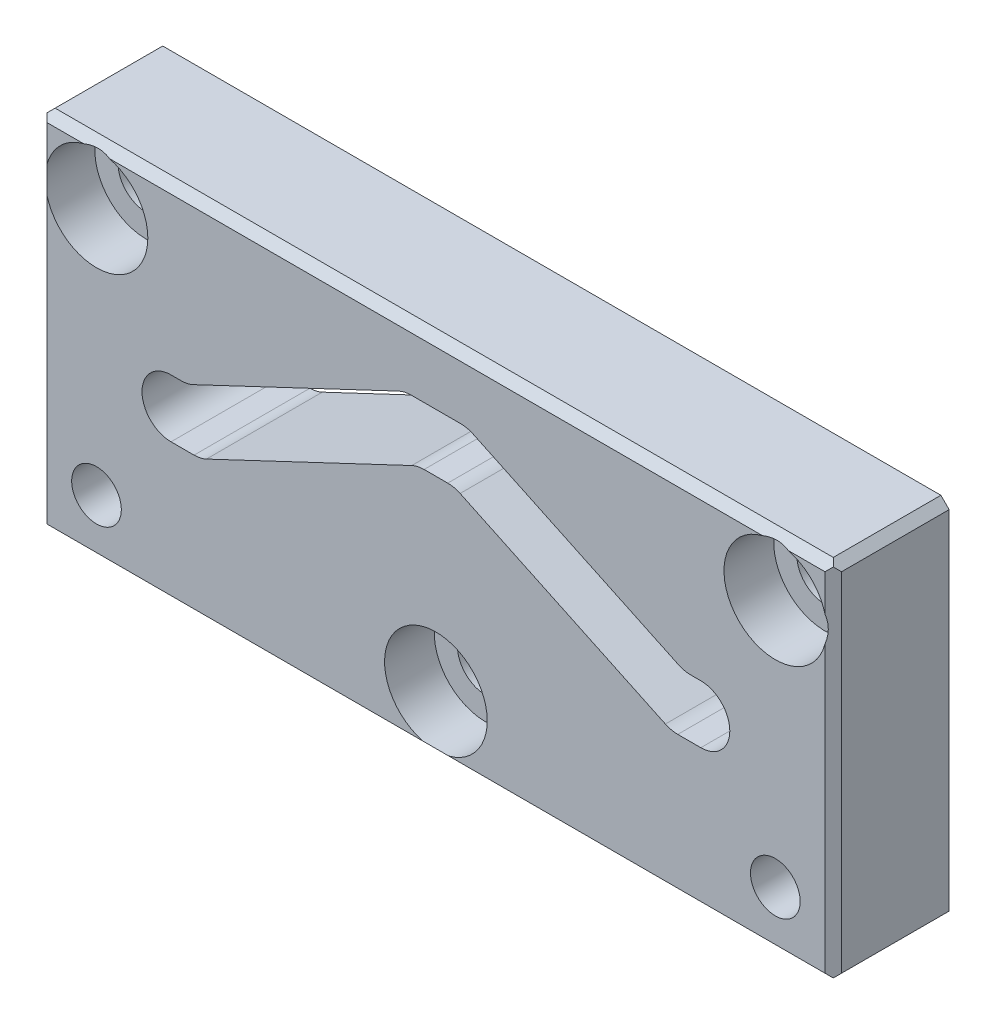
ISO-10303-21;
HEADER;
FILE_DESCRIPTION(('STEP AP214'),'2;1');
FILE_NAME('part.step','',(''),(''),'','','');
FILE_SCHEMA(('AUTOMOTIVE_DESIGN { 1 0 10303 214 1 1 1 1 }'));
ENDSEC;
DATA;
#1=APPLICATION_CONTEXT('core data for automotive mechanical design processes');
#2=APPLICATION_PROTOCOL_DEFINITION('international standard','automotive_design',2000,#1);
#3=PRODUCT_CONTEXT('',#1,'mechanical');
#4=PRODUCT('Part','Part','',(#3));
#5=PRODUCT_RELATED_PRODUCT_CATEGORY('part','',(#4));
#6=PRODUCT_DEFINITION_FORMATION('','',#4);
#7=PRODUCT_DEFINITION_CONTEXT('part definition',#1,'design');
#8=PRODUCT_DEFINITION('design','',#6,#7);
#9=PRODUCT_DEFINITION_SHAPE('','',#8);
#10=(LENGTH_UNIT() NAMED_UNIT(*) SI_UNIT(.MILLI.,.METRE.));
#11=(NAMED_UNIT(*) PLANE_ANGLE_UNIT() SI_UNIT($,.RADIAN.));
#12=(NAMED_UNIT(*) SI_UNIT($,.STERADIAN.) SOLID_ANGLE_UNIT());
#13=UNCERTAINTY_MEASURE_WITH_UNIT(LENGTH_MEASURE(1.E-05),#10,'distance_accuracy_value','');
#14=(GEOMETRIC_REPRESENTATION_CONTEXT(3) GLOBAL_UNCERTAINTY_ASSIGNED_CONTEXT((#13)) GLOBAL_UNIT_ASSIGNED_CONTEXT((#10,
#11,#12)) REPRESENTATION_CONTEXT('',''));
#15=CARTESIAN_POINT('',(0.,0.,0.));
#16=DIRECTION('',(0.,0.,1.));
#17=DIRECTION('',(1.,0.,0.));
#18=AXIS2_PLACEMENT_3D('',#15,#16,#17);
#19=CARTESIAN_POINT('',(-10.1090002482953,6.86267638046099,7.));
#20=DIRECTION('',(0.,0.,-1.));
#21=DIRECTION('',(-1.,0.,0.));
#22=AXIS2_PLACEMENT_3D('',#19,#20,#21);
#23=PLANE('',#22);
#24=CARTESIAN_POINT('',(-13.6090002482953,10.362676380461,7.));
#25=DIRECTION('',(0.,0.,1.));
#26=DIRECTION('',(-1.,0.,0.));
#27=AXIS2_PLACEMENT_3D('',#24,#25,#26);
#28=CIRCLE('',#27,1.5);
#29=CARTESIAN_POINT('',(-15.1090002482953,10.362676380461,7.));
#30=VERTEX_POINT('',#29);
#31=EDGE_CURVE('E517',#30,#30,#28,.T.);
#32=ORIENTED_EDGE('',*,*,#31,.F.);
#33=EDGE_LOOP('',(#32));
#34=FACE_BOUND('',#33,.T.);
#35=CARTESIAN_POINT('',(-54.6090002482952,10.362676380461,7.));
#36=DIRECTION('',(0.,0.,1.));
#37=DIRECTION('',(1.,0.,0.));
#38=AXIS2_PLACEMENT_3D('',#35,#36,#37);
#39=CIRCLE('',#38,1.5);
#40=CARTESIAN_POINT('',(-53.1090002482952,10.362676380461,7.));
#41=VERTEX_POINT('',#40);
#42=EDGE_CURVE('E527',#41,#41,#39,.T.);
#43=ORIENTED_EDGE('',*,*,#42,.F.);
#44=EDGE_LOOP('',(#43));
#45=FACE_BOUND('',#44,.T.);
#46=DIRECTION('',(0.904084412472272,-0.42735392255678,0.));
#47=VECTOR('',#46,1.);
#48=CARTESIAN_POINT('',(-19.8945424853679,15.409667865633,7.));
#49=LINE('',#48,#47);
#50=CARTESIAN_POINT('',(-32.647455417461,21.4378741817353,7.));
#51=VERTEX_POINT('',#50);
#52=CARTESIAN_POINT('',(-20.2496407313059,15.5775201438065,7.));
#53=VERTEX_POINT('',#52);
#54=EDGE_CURVE('E317',#51,#53,#49,.T.);
#55=ORIENTED_EDGE('',*,*,#54,.F.);
#56=CARTESIAN_POINT('',(-33.3953247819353,19.8557264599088,7.));
#57=DIRECTION('',(0.,0.,-1.));
#58=DIRECTION('',(-1.,0.,0.));
#59=AXIS2_PLACEMENT_3D('',#56,#57,#58);
#60=CIRCLE('',#59,1.75);
#61=CARTESIAN_POINT('',(-33.3953247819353,21.6057264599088,7.));
#62=VERTEX_POINT('',#61);
#63=EDGE_CURVE('E389',#51,#62,#60,.F.);
#64=ORIENTED_EDGE('',*,*,#63,.T.);
#65=DIRECTION('',(1.,0.,0.));
#66=VECTOR('',#65,1.);
#67=CARTESIAN_POINT('',(-35.2154468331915,21.6057264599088,7.));
#68=LINE('',#67,#66);
#69=CARTESIAN_POINT('',(-34.8226757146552,21.6057264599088,7.));
#70=VERTEX_POINT('',#69);
#71=EDGE_CURVE('E313',#70,#62,#68,.T.);
#72=ORIENTED_EDGE('',*,*,#71,.F.);
#73=CARTESIAN_POINT('',(-34.8226757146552,19.8557264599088,7.));
#74=DIRECTION('',(0.,0.,-1.));
#75=DIRECTION('',(-1.,0.,0.));
#76=AXIS2_PLACEMENT_3D('',#73,#74,#75);
#77=CIRCLE('',#76,1.75);
#78=CARTESIAN_POINT('',(-35.5705450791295,21.4378741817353,7.));
#79=VERTEX_POINT('',#78);
#80=EDGE_CURVE('E387',#70,#79,#77,.F.);
#81=ORIENTED_EDGE('',*,*,#80,.T.);
#82=DIRECTION('',(0.904084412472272,0.427353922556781,0.));
#83=VECTOR('',#82,1.);
#84=CARTESIAN_POINT('',(-48.3234580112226,15.4096678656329,7.));
#85=LINE('',#84,#83);
#86=CARTESIAN_POINT('',(-47.9683597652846,15.5775201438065,7.));
#87=VERTEX_POINT('',#86);
#88=EDGE_CURVE('E310',#87,#79,#85,.T.);
#89=ORIENTED_EDGE('',*,*,#88,.F.);
#90=CARTESIAN_POINT('',(-48.7162291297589,17.1596678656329,7.));
#91=DIRECTION('',(0.,0.,-1.));
#92=DIRECTION('',(-1.,0.,0.));
#93=AXIS2_PLACEMENT_3D('',#90,#91,#92);
#94=CIRCLE('',#93,1.75);
#95=CARTESIAN_POINT('',(-48.7162291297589,15.4096678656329,7.));
#96=VERTEX_POINT('',#95);
#97=EDGE_CURVE('E424',#87,#96,#94,.T.);
#98=ORIENTED_EDGE('',*,*,#97,.T.);
#99=DIRECTION('',(1.,0.,0.));
#100=VECTOR('',#99,1.);
#101=CARTESIAN_POINT('',(-50.1090002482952,15.4096678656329,7.));
#102=LINE('',#101,#100);
#103=CARTESIAN_POINT('',(-50.1090002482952,15.4096678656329,7.));
#104=VERTEX_POINT('',#103);
#105=EDGE_CURVE('E345',#104,#96,#102,.T.);
#106=ORIENTED_EDGE('',*,*,#105,.F.);
#107=CARTESIAN_POINT('',(-50.1090002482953,17.1596678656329,7.));
#108=DIRECTION('',(0.,0.,1.));
#109=DIRECTION('',(1.,0.,0.));
#110=AXIS2_PLACEMENT_3D('',#107,#108,#109);
#111=CIRCLE('',#110,1.75);
#112=CARTESIAN_POINT('',(-50.1090002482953,18.9096678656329,7.));
#113=VERTEX_POINT('',#112);
#114=EDGE_CURVE('E342',#113,#104,#111,.T.);
#115=ORIENTED_EDGE('',*,*,#114,.F.);
#116=DIRECTION('',(-1.,0.,0.));
#117=VECTOR('',#116,1.);
#118=CARTESIAN_POINT('',(-50.1090002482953,18.9096678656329,7.));
#119=LINE('',#118,#117);
#120=CARTESIAN_POINT('',(-49.5017713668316,18.9096678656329,7.));
#121=VERTEX_POINT('',#120);
#122=EDGE_CURVE('E340',#121,#113,#119,.T.);
#123=ORIENTED_EDGE('',*,*,#122,.F.);
#124=CARTESIAN_POINT('',(-49.5017713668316,20.659667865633,7.));
#125=DIRECTION('',(0.,0.,-1.));
#126=DIRECTION('',(-1.,0.,0.));
#127=AXIS2_PLACEMENT_3D('',#124,#125,#126);
#128=CIRCLE('',#127,1.75);
#129=CARTESIAN_POINT('',(-48.7539020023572,19.0775201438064,7.));
#130=VERTEX_POINT('',#129);
#131=EDGE_CURVE('E383',#121,#130,#128,.F.);
#132=ORIENTED_EDGE('',*,*,#131,.T.);
#133=DIRECTION('',(-0.904084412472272,-0.427353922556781,0.));
#134=VECTOR('',#133,1.);
#135=CARTESIAN_POINT('',(-49.1090002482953,18.9096678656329,7.));
#136=LINE('',#135,#134);
#137=CARTESIAN_POINT('',(-36.3553800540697,24.9382084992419,7.));
#138=VERTEX_POINT('',#137);
#139=EDGE_CURVE('E337',#138,#130,#136,.T.);
#140=ORIENTED_EDGE('',*,*,#139,.F.);
#141=CARTESIAN_POINT('',(-35.6090002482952,23.3592119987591,7.));
#142=DIRECTION('',(0.,0.,1.));
#143=DIRECTION('',(1.,0.,0.));
#144=AXIS2_PLACEMENT_3D('',#141,#142,#143);
#145=CIRCLE('',#144,1.74651446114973);
#146=CARTESIAN_POINT('',(-35.6090002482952,25.1057264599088,7.));
#147=VERTEX_POINT('',#146);
#148=EDGE_CURVE('E334',#147,#138,#145,.T.);
#149=ORIENTED_EDGE('',*,*,#148,.F.);
#150=DIRECTION('',(-1.,0.,0.));
#151=VECTOR('',#150,1.);
#152=CARTESIAN_POINT('',(-35.6090002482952,25.1057264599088,7.));
#153=LINE('',#152,#151);
#154=CARTESIAN_POINT('',(-32.6090002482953,25.1057264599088,7.));
#155=VERTEX_POINT('',#154);
#156=EDGE_CURVE('E331',#155,#147,#153,.T.);
#157=ORIENTED_EDGE('',*,*,#156,.F.);
#158=CARTESIAN_POINT('',(-32.6090002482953,23.3592119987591,7.));
#159=DIRECTION('',(0.,0.,1.));
#160=DIRECTION('',(-1.,0.,0.));
#161=AXIS2_PLACEMENT_3D('',#158,#159,#160);
#162=CIRCLE('',#161,1.74651446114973);
#163=CARTESIAN_POINT('',(-31.8626204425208,24.9382084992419,7.));
#164=VERTEX_POINT('',#163);
#165=EDGE_CURVE('E328',#164,#155,#162,.T.);
#166=ORIENTED_EDGE('',*,*,#165,.F.);
#167=DIRECTION('',(-0.904084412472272,0.427353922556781,0.));
#168=VECTOR('',#167,1.);
#169=CARTESIAN_POINT('',(-19.1090002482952,18.9096678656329,7.));
#170=LINE('',#169,#168);
#171=CARTESIAN_POINT('',(-19.4640984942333,19.0775201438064,7.));
#172=VERTEX_POINT('',#171);
#173=EDGE_CURVE('E326',#172,#164,#170,.T.);
#174=ORIENTED_EDGE('',*,*,#173,.F.);
#175=CARTESIAN_POINT('',(-18.7162291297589,20.659667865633,7.));
#176=DIRECTION('',(0.,0.,-1.));
#177=DIRECTION('',(-1.,0.,0.));
#178=AXIS2_PLACEMENT_3D('',#175,#176,#177);
#179=CIRCLE('',#178,1.75);
#180=CARTESIAN_POINT('',(-18.7162291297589,18.9096678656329,7.));
#181=VERTEX_POINT('',#180);
#182=EDGE_CURVE('E385',#172,#181,#179,.F.);
#183=ORIENTED_EDGE('',*,*,#182,.T.);
#184=DIRECTION('',(-1.,0.,0.));
#185=VECTOR('',#184,1.);
#186=CARTESIAN_POINT('',(-18.1090002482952,18.9096678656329,7.));
#187=LINE('',#186,#185);
#188=CARTESIAN_POINT('',(-18.1090002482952,18.9096678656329,7.));
#189=VERTEX_POINT('',#188);
#190=EDGE_CURVE('E323',#189,#181,#187,.T.);
#191=ORIENTED_EDGE('',*,*,#190,.F.);
#192=CARTESIAN_POINT('',(-18.1090002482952,17.1596678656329,7.));
#193=DIRECTION('',(0.,0.,1.));
#194=DIRECTION('',(-1.,0.,0.));
#195=AXIS2_PLACEMENT_3D('',#192,#193,#194);
#196=CIRCLE('',#195,1.75);
#197=CARTESIAN_POINT('',(-18.1090002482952,15.409667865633,7.));
#198=VERTEX_POINT('',#197);
#199=EDGE_CURVE('E321',#198,#189,#196,.T.);
#200=ORIENTED_EDGE('',*,*,#199,.F.);
#201=DIRECTION('',(1.,0.,0.));
#202=VECTOR('',#201,1.);
#203=CARTESIAN_POINT('',(-18.1090002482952,15.409667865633,7.));
#204=LINE('',#203,#202);
#205=CARTESIAN_POINT('',(-19.5017713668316,15.409667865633,7.));
#206=VERTEX_POINT('',#205);
#207=EDGE_CURVE('E275',#206,#198,#204,.T.);
#208=ORIENTED_EDGE('',*,*,#207,.F.);
#209=CARTESIAN_POINT('',(-19.5017713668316,17.1596678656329,7.));
#210=DIRECTION('',(0.,0.,-1.));
#211=DIRECTION('',(-1.,0.,0.));
#212=AXIS2_PLACEMENT_3D('',#209,#210,#211);
#213=CIRCLE('',#212,1.75);
#214=EDGE_CURVE('E421',#206,#53,#213,.T.);
#215=ORIENTED_EDGE('',*,*,#214,.T.);
#216=EDGE_LOOP('',(#55,#64,#72,#81,#89,#98,#106,#115,#123,#132,#140,#149,#157,#166,#174,#183,
#191,#200,#208,#215));
#217=FACE_BOUND('',#216,.T.);
#218=CARTESIAN_POINT('',(-34.1090002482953,10.362676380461,7.));
#219=DIRECTION('',(0.,0.,1.));
#220=DIRECTION('',(1.,0.,0.));
#221=AXIS2_PLACEMENT_3D('',#218,#219,#220);
#222=CIRCLE('',#221,3.1);
#223=CARTESIAN_POINT('',(-33.3279752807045,7.362676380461,7.));
#224=VERTEX_POINT('',#223);
#225=CARTESIAN_POINT('',(-34.890025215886,7.362676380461,7.));
#226=VERTEX_POINT('',#225);
#227=EDGE_CURVE('E548',#224,#226,#222,.T.);
#228=ORIENTED_EDGE('',*,*,#227,.F.);
#229=DIRECTION('',(1.,0.,0.));
#230=VECTOR('',#229,1.);
#231=CARTESIAN_POINT('',(-10.1090002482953,7.362676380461,7.));
#232=LINE('',#231,#230);
#233=CARTESIAN_POINT('',(-10.6090002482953,7.362676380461,7.));
#234=VERTEX_POINT('',#233);
#235=EDGE_CURVE('E472',#224,#234,#232,.T.);
#236=ORIENTED_EDGE('',*,*,#235,.T.);
#237=DIRECTION('',(0.,1.,0.));
#238=VECTOR('',#237,1.);
#239=CARTESIAN_POINT('',(-10.6090002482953,6.86267638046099,7.));
#240=LINE('',#239,#238);
#241=CARTESIAN_POINT('',(-10.6090002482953,24.5816514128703,7.));
#242=VERTEX_POINT('',#241);
#243=EDGE_CURVE('E470',#234,#242,#240,.T.);
#244=ORIENTED_EDGE('',*,*,#243,.T.);
#245=CARTESIAN_POINT('',(-13.6090002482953,25.362676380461,7.));
#246=DIRECTION('',(0.,0.,1.));
#247=DIRECTION('',(1.,0.,0.));
#248=AXIS2_PLACEMENT_3D('',#245,#246,#247);
#249=CIRCLE('',#248,3.1);
#250=CARTESIAN_POINT('',(-14.3900252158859,28.362676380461,7.));
#251=VERTEX_POINT('',#250);
#252=EDGE_CURVE('E560',#251,#242,#249,.T.);
#253=ORIENTED_EDGE('',*,*,#252,.F.);
#254=DIRECTION('',(-1.,0.,0.));
#255=VECTOR('',#254,1.);
#256=CARTESIAN_POINT('',(-10.1090002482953,28.362676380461,7.));
#257=LINE('',#256,#255);
#258=CARTESIAN_POINT('',(-53.8279752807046,28.362676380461,7.));
#259=VERTEX_POINT('',#258);
#260=EDGE_CURVE('E459',#251,#259,#257,.T.);
#261=ORIENTED_EDGE('',*,*,#260,.T.);
#262=CARTESIAN_POINT('',(-54.6090002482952,25.362676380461,7.));
#263=DIRECTION('',(0.,0.,1.));
#264=DIRECTION('',(1.,0.,0.));
#265=AXIS2_PLACEMENT_3D('',#262,#263,#264);
#266=CIRCLE('',#265,3.1);
#267=CARTESIAN_POINT('',(-57.6090002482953,24.5816514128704,7.));
#268=VERTEX_POINT('',#267);
#269=EDGE_CURVE('E535',#268,#259,#266,.T.);
#270=ORIENTED_EDGE('',*,*,#269,.F.);
#271=DIRECTION('',(0.,-1.,0.));
#272=VECTOR('',#271,1.);
#273=CARTESIAN_POINT('',(-57.6090002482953,6.86267638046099,7.));
#274=LINE('',#273,#272);
#275=CARTESIAN_POINT('',(-57.6090002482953,7.362676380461,7.));
#276=VERTEX_POINT('',#275);
#277=EDGE_CURVE('E465',#268,#276,#274,.T.);
#278=ORIENTED_EDGE('',*,*,#277,.T.);
#279=DIRECTION('',(1.,0.,0.));
#280=VECTOR('',#279,1.);
#281=CARTESIAN_POINT('',(-10.1090002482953,7.362676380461,7.));
#282=LINE('',#281,#280);
#283=EDGE_CURVE('E467',#276,#226,#282,.T.);
#284=ORIENTED_EDGE('',*,*,#283,.T.);
#285=EDGE_LOOP('',(#228,#236,#244,#253,#261,#270,#278,#284));
#286=FACE_BOUND('',#285,.T.);
#287=ADVANCED_FACE('F16',(#34,#45,#217,#286),#23,.F.);
#288=CARTESIAN_POINT('',(-10.6090002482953,26.1437013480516,7.));
#289=VERTEX_POINT('',#288);
#290=CARTESIAN_POINT('',(-12.8279752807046,28.362676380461,7.));
#291=VERTEX_POINT('',#290);
#292=EDGE_CURVE('E561',#289,#291,#249,.T.);
#293=ORIENTED_EDGE('',*,*,#292,.F.);
#294=DIRECTION('',(0.,1.,0.));
#295=VECTOR('',#294,1.);
#296=CARTESIAN_POINT('',(-10.6090002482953,6.86267638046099,7.));
#297=LINE('',#296,#295);
#298=CARTESIAN_POINT('',(-10.6090002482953,28.362676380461,7.));
#299=VERTEX_POINT('',#298);
#300=EDGE_CURVE('E463',#289,#299,#297,.T.);
#301=ORIENTED_EDGE('',*,*,#300,.T.);
#302=DIRECTION('',(-1.,0.,0.));
#303=VECTOR('',#302,1.);
#304=CARTESIAN_POINT('',(-10.1090002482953,28.362676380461,7.));
#305=LINE('',#304,#303);
#306=EDGE_CURVE('E461',#299,#291,#305,.T.);
#307=ORIENTED_EDGE('',*,*,#306,.T.);
#308=EDGE_LOOP('',(#293,#301,#307));
#309=FACE_BOUND('',#308,.T.);
#310=ADVANCED_FACE('F664',(#309),#23,.F.);
#311=CARTESIAN_POINT('',(-10.1090002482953,6.86267638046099,0.));
#312=DIRECTION('',(0.,0.,-1.));
#313=DIRECTION('',(-1.,0.,0.));
#314=AXIS2_PLACEMENT_3D('',#311,#312,#313);
#315=PLANE('',#314);
#316=CARTESIAN_POINT('',(-13.6090002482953,10.362676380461,0.));
#317=DIRECTION('',(0.,0.,-1.));
#318=DIRECTION('',(-1.,0.,0.));
#319=AXIS2_PLACEMENT_3D('',#316,#317,#318);
#320=CIRCLE('',#319,1.5);
#321=CARTESIAN_POINT('',(-15.1090002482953,10.362676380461,0.));
#322=VERTEX_POINT('',#321);
#323=EDGE_CURVE('E522',#322,#322,#320,.T.);
#324=ORIENTED_EDGE('',*,*,#323,.F.);
#325=EDGE_LOOP('',(#324));
#326=FACE_BOUND('',#325,.T.);
#327=CARTESIAN_POINT('',(-54.6090002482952,10.362676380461,0.));
#328=DIRECTION('',(0.,0.,-1.));
#329=DIRECTION('',(-1.,0.,0.));
#330=AXIS2_PLACEMENT_3D('',#327,#328,#329);
#331=CIRCLE('',#330,1.5);
#332=CARTESIAN_POINT('',(-56.1090002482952,10.362676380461,0.));
#333=VERTEX_POINT('',#332);
#334=EDGE_CURVE('E532',#333,#333,#331,.T.);
#335=ORIENTED_EDGE('',*,*,#334,.F.);
#336=EDGE_LOOP('',(#335));
#337=FACE_BOUND('',#336,.T.);
#338=CARTESIAN_POINT('',(-13.6090002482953,25.362676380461,0.));
#339=DIRECTION('',(0.,0.,1.));
#340=DIRECTION('',(1.,0.,0.));
#341=AXIS2_PLACEMENT_3D('',#338,#339,#340);
#342=CIRCLE('',#341,1.7);
#343=CARTESIAN_POINT('',(-11.9090002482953,25.362676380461,0.));
#344=VERTEX_POINT('',#343);
#345=EDGE_CURVE('E314',#344,#344,#342,.T.);
#346=ORIENTED_EDGE('',*,*,#345,.T.);
#347=EDGE_LOOP('',(#346));
#348=FACE_BOUND('',#347,.T.);
#349=DIRECTION('',(1.,0.,0.));
#350=VECTOR('',#349,1.);
#351=CARTESIAN_POINT('',(-35.2154468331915,21.6057264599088,0.));
#352=LINE('',#351,#350);
#353=CARTESIAN_POINT('',(-34.8226757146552,21.6057264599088,0.));
#354=VERTEX_POINT('',#353);
#355=CARTESIAN_POINT('',(-33.3953247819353,21.6057264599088,0.));
#356=VERTEX_POINT('',#355);
#357=EDGE_CURVE('E574',#354,#356,#352,.T.);
#358=ORIENTED_EDGE('',*,*,#357,.T.);
#359=CARTESIAN_POINT('',(-33.3953247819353,19.8557264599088,0.));
#360=DIRECTION('',(0.,0.,-1.));
#361=DIRECTION('',(-1.,0.,0.));
#362=AXIS2_PLACEMENT_3D('',#359,#360,#361);
#363=CIRCLE('',#362,1.75);
#364=CARTESIAN_POINT('',(-32.647455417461,21.4378741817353,0.));
#365=VERTEX_POINT('',#364);
#366=EDGE_CURVE('E402',#356,#365,#363,.T.);
#367=ORIENTED_EDGE('',*,*,#366,.T.);
#368=DIRECTION('',(0.904084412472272,-0.42735392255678,0.));
#369=VECTOR('',#368,1.);
#370=CARTESIAN_POINT('',(-19.8945424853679,15.409667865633,0.));
#371=LINE('',#370,#369);
#372=CARTESIAN_POINT('',(-20.2496407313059,15.5775201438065,0.));
#373=VERTEX_POINT('',#372);
#374=EDGE_CURVE('E269',#365,#373,#371,.T.);
#375=ORIENTED_EDGE('',*,*,#374,.T.);
#376=CARTESIAN_POINT('',(-19.5017713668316,17.1596678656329,0.));
#377=DIRECTION('',(0.,0.,-1.));
#378=DIRECTION('',(-1.,0.,0.));
#379=AXIS2_PLACEMENT_3D('',#376,#377,#378);
#380=CIRCLE('',#379,1.75);
#381=CARTESIAN_POINT('',(-19.5017713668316,15.409667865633,0.));
#382=VERTEX_POINT('',#381);
#383=EDGE_CURVE('E265',#373,#382,#380,.F.);
#384=ORIENTED_EDGE('',*,*,#383,.T.);
#385=DIRECTION('',(1.,0.,0.));
#386=VECTOR('',#385,1.);
#387=CARTESIAN_POINT('',(-18.1090002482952,15.409667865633,0.));
#388=LINE('',#387,#386);
#389=CARTESIAN_POINT('',(-18.1090002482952,15.409667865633,0.));
#390=VERTEX_POINT('',#389);
#391=EDGE_CURVE('E255',#382,#390,#388,.T.);
#392=ORIENTED_EDGE('',*,*,#391,.T.);
#393=CARTESIAN_POINT('',(-18.1090002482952,17.1596678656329,0.));
#394=DIRECTION('',(0.,0.,1.));
#395=DIRECTION('',(-1.,0.,0.));
#396=AXIS2_PLACEMENT_3D('',#393,#394,#395);
#397=CIRCLE('',#396,1.75);
#398=CARTESIAN_POINT('',(-18.1090002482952,18.9096678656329,0.));
#399=VERTEX_POINT('',#398);
#400=EDGE_CURVE('E262',#390,#399,#397,.T.);
#401=ORIENTED_EDGE('',*,*,#400,.T.);
#402=DIRECTION('',(-1.,0.,0.));
#403=VECTOR('',#402,1.);
#404=CARTESIAN_POINT('',(-18.1090002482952,18.9096678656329,0.));
#405=LINE('',#404,#403);
#406=CARTESIAN_POINT('',(-18.7162291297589,18.9096678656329,0.));
#407=VERTEX_POINT('',#406);
#408=EDGE_CURVE('E284',#399,#407,#405,.T.);
#409=ORIENTED_EDGE('',*,*,#408,.T.);
#410=CARTESIAN_POINT('',(-18.7162291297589,20.659667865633,0.));
#411=DIRECTION('',(0.,0.,-1.));
#412=DIRECTION('',(-1.,0.,0.));
#413=AXIS2_PLACEMENT_3D('',#410,#411,#412);
#414=CIRCLE('',#413,1.75);
#415=CARTESIAN_POINT('',(-19.4640984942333,19.0775201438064,0.));
#416=VERTEX_POINT('',#415);
#417=EDGE_CURVE('E398',#407,#416,#414,.T.);
#418=ORIENTED_EDGE('',*,*,#417,.T.);
#419=DIRECTION('',(-0.904084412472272,0.427353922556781,0.));
#420=VECTOR('',#419,1.);
#421=CARTESIAN_POINT('',(-19.1090002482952,18.9096678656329,0.));
#422=LINE('',#421,#420);
#423=CARTESIAN_POINT('',(-31.8626204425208,24.9382084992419,0.));
#424=VERTEX_POINT('',#423);
#425=EDGE_CURVE('E286',#416,#424,#422,.T.);
#426=ORIENTED_EDGE('',*,*,#425,.T.);
#427=CARTESIAN_POINT('',(-32.6090002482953,23.3592119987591,0.));
#428=DIRECTION('',(0.,0.,1.));
#429=DIRECTION('',(-1.,0.,0.));
#430=AXIS2_PLACEMENT_3D('',#427,#428,#429);
#431=CIRCLE('',#430,1.74651446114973);
#432=CARTESIAN_POINT('',(-32.6090002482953,25.1057264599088,0.));
#433=VERTEX_POINT('',#432);
#434=EDGE_CURVE('E291',#424,#433,#431,.T.);
#435=ORIENTED_EDGE('',*,*,#434,.T.);
#436=DIRECTION('',(-1.,0.,0.));
#437=VECTOR('',#436,1.);
#438=CARTESIAN_POINT('',(-35.6090002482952,25.1057264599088,0.));
#439=LINE('',#438,#437);
#440=CARTESIAN_POINT('',(-35.6090002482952,25.1057264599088,0.));
#441=VERTEX_POINT('',#440);
#442=EDGE_CURVE('E294',#433,#441,#439,.T.);
#443=ORIENTED_EDGE('',*,*,#442,.T.);
#444=CARTESIAN_POINT('',(-35.6090002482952,23.3592119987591,0.));
#445=DIRECTION('',(0.,0.,1.));
#446=DIRECTION('',(1.,0.,0.));
#447=AXIS2_PLACEMENT_3D('',#444,#445,#446);
#448=CIRCLE('',#447,1.74651446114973);
#449=CARTESIAN_POINT('',(-36.3553800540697,24.9382084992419,0.));
#450=VERTEX_POINT('',#449);
#451=EDGE_CURVE('E297',#441,#450,#448,.T.);
#452=ORIENTED_EDGE('',*,*,#451,.T.);
#453=DIRECTION('',(-0.904084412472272,-0.427353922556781,0.));
#454=VECTOR('',#453,1.);
#455=CARTESIAN_POINT('',(-49.1090002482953,18.9096678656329,0.));
#456=LINE('',#455,#454);
#457=CARTESIAN_POINT('',(-48.7539020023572,19.0775201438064,0.));
#458=VERTEX_POINT('',#457);
#459=EDGE_CURVE('E300',#450,#458,#456,.T.);
#460=ORIENTED_EDGE('',*,*,#459,.T.);
#461=CARTESIAN_POINT('',(-49.5017713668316,20.659667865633,0.));
#462=DIRECTION('',(0.,0.,-1.));
#463=DIRECTION('',(-1.,0.,0.));
#464=AXIS2_PLACEMENT_3D('',#461,#462,#463);
#465=CIRCLE('',#464,1.75);
#466=CARTESIAN_POINT('',(-49.5017713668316,18.9096678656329,0.));
#467=VERTEX_POINT('',#466);
#468=EDGE_CURVE('E396',#458,#467,#465,.T.);
#469=ORIENTED_EDGE('',*,*,#468,.T.);
#470=DIRECTION('',(-1.,0.,0.));
#471=VECTOR('',#470,1.);
#472=CARTESIAN_POINT('',(-50.1090002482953,18.9096678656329,0.));
#473=LINE('',#472,#471);
#474=CARTESIAN_POINT('',(-50.1090002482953,18.9096678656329,0.));
#475=VERTEX_POINT('',#474);
#476=EDGE_CURVE('E303',#467,#475,#473,.T.);
#477=ORIENTED_EDGE('',*,*,#476,.T.);
#478=CARTESIAN_POINT('',(-50.1090002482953,17.1596678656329,0.));
#479=DIRECTION('',(0.,0.,1.));
#480=DIRECTION('',(1.,0.,0.));
#481=AXIS2_PLACEMENT_3D('',#478,#479,#480);
#482=CIRCLE('',#481,1.75);
#483=CARTESIAN_POINT('',(-50.1090002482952,15.4096678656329,0.));
#484=VERTEX_POINT('',#483);
#485=EDGE_CURVE('E305',#475,#484,#482,.T.);
#486=ORIENTED_EDGE('',*,*,#485,.T.);
#487=DIRECTION('',(1.,0.,0.));
#488=VECTOR('',#487,1.);
#489=CARTESIAN_POINT('',(-50.1090002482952,15.4096678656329,0.));
#490=LINE('',#489,#488);
#491=CARTESIAN_POINT('',(-48.7162291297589,15.4096678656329,0.));
#492=VERTEX_POINT('',#491);
#493=EDGE_CURVE('E280',#484,#492,#490,.T.);
#494=ORIENTED_EDGE('',*,*,#493,.T.);
#495=CARTESIAN_POINT('',(-48.7162291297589,17.1596678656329,0.));
#496=DIRECTION('',(0.,0.,-1.));
#497=DIRECTION('',(-1.,0.,0.));
#498=AXIS2_PLACEMENT_3D('',#495,#496,#497);
#499=CIRCLE('',#498,1.75);
#500=CARTESIAN_POINT('',(-47.9683597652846,15.5775201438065,0.));
#501=VERTEX_POINT('',#500);
#502=EDGE_CURVE('E426',#492,#501,#499,.F.);
#503=ORIENTED_EDGE('',*,*,#502,.T.);
#504=DIRECTION('',(0.904084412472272,0.427353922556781,0.));
#505=VECTOR('',#504,1.);
#506=CARTESIAN_POINT('',(-48.3234580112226,15.4096678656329,0.));
#507=LINE('',#506,#505);
#508=CARTESIAN_POINT('',(-35.5705450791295,21.4378741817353,0.));
#509=VERTEX_POINT('',#508);
#510=EDGE_CURVE('E348',#501,#509,#507,.T.);
#511=ORIENTED_EDGE('',*,*,#510,.T.);
#512=CARTESIAN_POINT('',(-34.8226757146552,19.8557264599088,0.));
#513=DIRECTION('',(0.,0.,-1.));
#514=DIRECTION('',(-1.,0.,0.));
#515=AXIS2_PLACEMENT_3D('',#512,#513,#514);
#516=CIRCLE('',#515,1.75);
#517=EDGE_CURVE('E400',#509,#354,#516,.T.);
#518=ORIENTED_EDGE('',*,*,#517,.T.);
#519=EDGE_LOOP('',(#358,#367,#375,#384,#392,#401,#409,#418,#426,#435,#443,#452,#460,#469,#477,
#486,#494,#503,#511,#518));
#520=FACE_BOUND('',#519,.T.);
#521=DIRECTION('',(0.,1.,0.));
#522=VECTOR('',#521,1.);
#523=CARTESIAN_POINT('',(-10.1090002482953,28.862676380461,0.));
#524=LINE('',#523,#522);
#525=CARTESIAN_POINT('',(-10.1090002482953,7.36267638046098,0.));
#526=VERTEX_POINT('',#525);
#527=CARTESIAN_POINT('',(-10.1090002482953,28.362676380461,0.));
#528=VERTEX_POINT('',#527);
#529=EDGE_CURVE('E367',#526,#528,#524,.T.);
#530=ORIENTED_EDGE('',*,*,#529,.F.);
#531=DIRECTION('',(0.707106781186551,0.707106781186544,0.));
#532=VECTOR('',#531,1.);
#533=CARTESIAN_POINT('',(-10.3590002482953,7.11267638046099,0.));
#534=LINE('',#533,#532);
#535=CARTESIAN_POINT('',(-10.6090002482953,6.86267638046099,0.));
#536=VERTEX_POINT('',#535);
#537=EDGE_CURVE('E439',#526,#536,#534,.F.);
#538=ORIENTED_EDGE('',*,*,#537,.T.);
#539=DIRECTION('',(1.,0.,0.));
#540=VECTOR('',#539,1.);
#541=CARTESIAN_POINT('',(-58.1090002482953,6.86267638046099,0.));
#542=LINE('',#541,#540);
#543=CARTESIAN_POINT('',(-57.6090002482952,6.86267638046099,0.));
#544=VERTEX_POINT('',#543);
#545=EDGE_CURVE('E351',#544,#536,#542,.T.);
#546=ORIENTED_EDGE('',*,*,#545,.F.);
#547=DIRECTION('',(0.707106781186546,-0.707106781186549,0.));
#548=VECTOR('',#547,1.);
#549=CARTESIAN_POINT('',(-33.8590002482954,-16.887323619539,0.));
#550=LINE('',#549,#548);
#551=CARTESIAN_POINT('',(-58.1090002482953,7.362676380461,0.));
#552=VERTEX_POINT('',#551);
#553=EDGE_CURVE('E437',#544,#552,#550,.F.);
#554=ORIENTED_EDGE('',*,*,#553,.T.);
#555=DIRECTION('',(0.,-1.,0.));
#556=VECTOR('',#555,1.);
#557=CARTESIAN_POINT('',(-58.1090002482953,28.862676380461,0.));
#558=LINE('',#557,#556);
#559=CARTESIAN_POINT('',(-58.1090002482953,28.362676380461,0.));
#560=VERTEX_POINT('',#559);
#561=EDGE_CURVE('E373',#560,#552,#558,.T.);
#562=ORIENTED_EDGE('',*,*,#561,.F.);
#563=DIRECTION('',(-0.707106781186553,-0.707106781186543,0.));
#564=VECTOR('',#563,1.);
#565=CARTESIAN_POINT('',(-44.8590002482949,41.6126763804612,0.));
#566=LINE('',#565,#564);
#567=CARTESIAN_POINT('',(-57.6090002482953,28.862676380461,0.));
#568=VERTEX_POINT('',#567);
#569=EDGE_CURVE('E433',#560,#568,#566,.F.);
#570=ORIENTED_EDGE('',*,*,#569,.T.);
#571=DIRECTION('',(-1.,0.,0.));
#572=VECTOR('',#571,1.);
#573=CARTESIAN_POINT('',(-58.1090002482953,28.862676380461,0.));
#574=LINE('',#573,#572);
#575=CARTESIAN_POINT('',(-10.6090002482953,28.862676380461,0.));
#576=VERTEX_POINT('',#575);
#577=EDGE_CURVE('E370',#576,#568,#574,.T.);
#578=ORIENTED_EDGE('',*,*,#577,.F.);
#579=DIRECTION('',(-0.70710678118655,0.707106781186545,0.));
#580=VECTOR('',#579,1.);
#581=CARTESIAN_POINT('',(0.640999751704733,17.6126763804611,0.));
#582=LINE('',#581,#580);
#583=EDGE_CURVE('E435',#576,#528,#582,.F.);
#584=ORIENTED_EDGE('',*,*,#583,.T.);
#585=EDGE_LOOP('',(#530,#538,#546,#554,#562,#570,#578,#584));
#586=FACE_BOUND('',#585,.T.);
#587=CARTESIAN_POINT('',(-34.1090002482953,10.362676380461,0.));
#588=DIRECTION('',(0.,0.,1.));
#589=DIRECTION('',(1.,0.,0.));
#590=AXIS2_PLACEMENT_3D('',#587,#588,#589);
#591=CIRCLE('',#590,1.7);
#592=CARTESIAN_POINT('',(-32.4090002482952,10.362676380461,0.));
#593=VERTEX_POINT('',#592);
#594=EDGE_CURVE('E557',#593,#593,#591,.T.);
#595=ORIENTED_EDGE('',*,*,#594,.T.);
#596=EDGE_LOOP('',(#595));
#597=FACE_BOUND('',#596,.T.);
#598=CARTESIAN_POINT('',(-54.6090002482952,25.362676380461,0.));
#599=DIRECTION('',(0.,0.,1.));
#600=DIRECTION('',(1.,0.,0.));
#601=AXIS2_PLACEMENT_3D('',#598,#599,#600);
#602=CIRCLE('',#601,1.7);
#603=CARTESIAN_POINT('',(-52.9090002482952,25.362676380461,0.));
#604=VERTEX_POINT('',#603);
#605=EDGE_CURVE('E545',#604,#604,#602,.T.);
#606=ORIENTED_EDGE('',*,*,#605,.T.);
#607=EDGE_LOOP('',(#606));
#608=FACE_BOUND('',#607,.T.);
#609=ADVANCED_FACE('F258',(#326,#337,#348,#520,#586,#597,#608),#315,.T.);
#610=DIRECTION('',(-1.,0.,0.));
#611=VECTOR('',#610,1.);
#612=CARTESIAN_POINT('',(-10.1090002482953,28.362676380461,7.));
#613=LINE('',#612,#611);
#614=CARTESIAN_POINT('',(-55.3900252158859,28.362676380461,7.));
#615=VERTEX_POINT('',#614);
#616=CARTESIAN_POINT('',(-57.6090002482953,28.362676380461,7.));
#617=VERTEX_POINT('',#616);
#618=EDGE_CURVE('E455',#615,#617,#613,.T.);
#619=ORIENTED_EDGE('',*,*,#618,.T.);
#620=DIRECTION('',(0.,-1.,0.));
#621=VECTOR('',#620,1.);
#622=CARTESIAN_POINT('',(-57.6090002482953,6.86267638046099,7.));
#623=LINE('',#622,#621);
#624=CARTESIAN_POINT('',(-57.6090002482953,26.1437013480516,7.));
#625=VERTEX_POINT('',#624);
#626=EDGE_CURVE('E457',#617,#625,#623,.T.);
#627=ORIENTED_EDGE('',*,*,#626,.T.);
#628=EDGE_CURVE('E538',#615,#625,#266,.T.);
#629=ORIENTED_EDGE('',*,*,#628,.F.);
#630=EDGE_LOOP('',(#619,#627,#629));
#631=FACE_BOUND('',#630,.T.);
#632=ADVANCED_FACE('F667',(#631),#23,.F.);
#633=CARTESIAN_POINT('',(-58.1090002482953,6.86267638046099,7.));
#634=DIRECTION('',(0.,1.,0.));
#635=DIRECTION('',(0.,0.,1.));
#636=AXIS2_PLACEMENT_3D('',#633,#634,#635);
#637=PLANE('',#636);
#638=DIRECTION('',(0.,0.,1.));
#639=VECTOR('',#638,1.);
#640=CARTESIAN_POINT('',(-10.6090002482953,6.86267638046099,7.));
#641=LINE('',#640,#639);
#642=CARTESIAN_POINT('',(-10.6090002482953,6.86267638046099,6.5));
#643=VERTEX_POINT('',#642);
#644=EDGE_CURVE('E443',#536,#643,#641,.T.);
#645=ORIENTED_EDGE('',*,*,#644,.T.);
#646=DIRECTION('',(-1.,0.,0.));
#647=VECTOR('',#646,1.);
#648=CARTESIAN_POINT('',(-58.1090002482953,6.86267638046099,6.5));
#649=LINE('',#648,#647);
#650=CARTESIAN_POINT('',(-57.6090002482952,6.86267638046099,6.5));
#651=VERTEX_POINT('',#650);
#652=EDGE_CURVE('E480',#643,#651,#649,.T.);
#653=ORIENTED_EDGE('',*,*,#652,.T.);
#654=DIRECTION('',(0.,0.,-1.));
#655=VECTOR('',#654,1.);
#656=CARTESIAN_POINT('',(-57.6090002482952,6.86267638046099,7.));
#657=LINE('',#656,#655);
#658=EDGE_CURVE('E441',#651,#544,#657,.T.);
#659=ORIENTED_EDGE('',*,*,#658,.T.);
#660=ORIENTED_EDGE('',*,*,#545,.T.);
#661=EDGE_LOOP('',(#645,#653,#659,#660));
#662=FACE_BOUND('',#661,.T.);
#663=ADVANCED_FACE('F677',(#662),#637,.F.);
#664=CARTESIAN_POINT('',(-10.1090002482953,28.862676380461,7.));
#665=DIRECTION('',(-1.,0.,0.));
#666=DIRECTION('',(0.,-1.,0.));
#667=AXIS2_PLACEMENT_3D('',#664,#665,#666);
#668=PLANE('',#667);
#669=DIRECTION('',(0.,0.,1.));
#670=VECTOR('',#669,1.);
#671=CARTESIAN_POINT('',(-10.1090002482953,28.362676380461,7.));
#672=LINE('',#671,#670);
#673=CARTESIAN_POINT('',(-10.1090002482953,28.362676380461,6.5));
#674=VERTEX_POINT('',#673);
#675=EDGE_CURVE('E428',#528,#674,#672,.T.);
#676=ORIENTED_EDGE('',*,*,#675,.T.);
#677=DIRECTION('',(0.,-1.,0.));
#678=VECTOR('',#677,1.);
#679=CARTESIAN_POINT('',(-10.1090002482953,28.862676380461,6.5));
#680=LINE('',#679,#678);
#681=CARTESIAN_POINT('',(-10.1090002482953,7.36267638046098,6.5));
#682=VERTEX_POINT('',#681);
#683=EDGE_CURVE('E495',#674,#682,#680,.T.);
#684=ORIENTED_EDGE('',*,*,#683,.T.);
#685=DIRECTION('',(0.,0.,-1.));
#686=VECTOR('',#685,1.);
#687=CARTESIAN_POINT('',(-10.1090002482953,7.36267638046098,7.));
#688=LINE('',#687,#686);
#689=EDGE_CURVE('E431',#682,#526,#688,.T.);
#690=ORIENTED_EDGE('',*,*,#689,.T.);
#691=ORIENTED_EDGE('',*,*,#529,.T.);
#692=EDGE_LOOP('',(#676,#684,#690,#691));
#693=FACE_BOUND('',#692,.T.);
#694=ADVANCED_FACE('F684',(#693),#668,.F.);
#695=CARTESIAN_POINT('',(-58.1090002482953,28.862676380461,7.));
#696=DIRECTION('',(0.,-1.,0.));
#697=DIRECTION('',(0.,0.,-1.));
#698=AXIS2_PLACEMENT_3D('',#695,#696,#697);
#699=PLANE('',#698);
#700=DIRECTION('',(0.,0.,1.));
#701=VECTOR('',#700,1.);
#702=CARTESIAN_POINT('',(-57.6090002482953,28.862676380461,7.));
#703=LINE('',#702,#701);
#704=CARTESIAN_POINT('',(-57.6090002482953,28.862676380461,6.5));
#705=VERTEX_POINT('',#704);
#706=EDGE_CURVE('E451',#568,#705,#703,.T.);
#707=ORIENTED_EDGE('',*,*,#706,.T.);
#708=DIRECTION('',(1.,0.,0.));
#709=VECTOR('',#708,1.);
#710=CARTESIAN_POINT('',(-58.1090002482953,28.862676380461,6.5));
#711=LINE('',#710,#709);
#712=CARTESIAN_POINT('',(-10.6090002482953,28.862676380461,6.5));
#713=VERTEX_POINT('',#712);
#714=EDGE_CURVE('E11',#705,#713,#711,.T.);
#715=ORIENTED_EDGE('',*,*,#714,.T.);
#716=DIRECTION('',(0.,0.,-1.));
#717=VECTOR('',#716,1.);
#718=CARTESIAN_POINT('',(-10.6090002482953,28.862676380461,7.));
#719=LINE('',#718,#717);
#720=EDGE_CURVE('E453',#713,#576,#719,.T.);
#721=ORIENTED_EDGE('',*,*,#720,.T.);
#722=ORIENTED_EDGE('',*,*,#577,.T.);
#723=EDGE_LOOP('',(#707,#715,#721,#722));
#724=FACE_BOUND('',#723,.T.);
#725=ADVANCED_FACE('F742',(#724),#699,.F.);
#726=CARTESIAN_POINT('',(-58.1090002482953,28.862676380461,7.));
#727=DIRECTION('',(1.,0.,0.));
#728=DIRECTION('',(0.,0.,-1.));
#729=AXIS2_PLACEMENT_3D('',#726,#727,#728);
#730=PLANE('',#729);
#731=DIRECTION('',(0.,0.,1.));
#732=VECTOR('',#731,1.);
#733=CARTESIAN_POINT('',(-58.1090002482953,7.362676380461,7.));
#734=LINE('',#733,#732);
#735=CARTESIAN_POINT('',(-58.1090002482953,7.362676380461,6.5));
#736=VERTEX_POINT('',#735);
#737=EDGE_CURVE('E448',#552,#736,#734,.T.);
#738=ORIENTED_EDGE('',*,*,#737,.T.);
#739=DIRECTION('',(0.,1.,0.));
#740=VECTOR('',#739,1.);
#741=CARTESIAN_POINT('',(-58.1090002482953,28.862676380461,6.5));
#742=LINE('',#741,#740);
#743=CARTESIAN_POINT('',(-58.1090002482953,28.362676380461,6.5));
#744=VERTEX_POINT('',#743);
#745=EDGE_CURVE('E501',#736,#744,#742,.T.);
#746=ORIENTED_EDGE('',*,*,#745,.T.);
#747=DIRECTION('',(0.,0.,-1.));
#748=VECTOR('',#747,1.);
#749=CARTESIAN_POINT('',(-58.1090002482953,28.362676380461,7.));
#750=LINE('',#749,#748);
#751=EDGE_CURVE('E446',#744,#560,#750,.T.);
#752=ORIENTED_EDGE('',*,*,#751,.T.);
#753=ORIENTED_EDGE('',*,*,#561,.T.);
#754=EDGE_LOOP('',(#738,#746,#752,#753));
#755=FACE_BOUND('',#754,.T.);
#756=ADVANCED_FACE('F747',(#755),#730,.F.);
#757=CARTESIAN_POINT('',(-48.3234580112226,15.4096678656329,0.));
#758=DIRECTION('',(0.427353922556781,-0.904084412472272,0.));
#759=DIRECTION('',(0.904084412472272,0.427353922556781,0.));
#760=AXIS2_PLACEMENT_3D('',#757,#758,#759);
#761=PLANE('',#760);
#762=ORIENTED_EDGE('',*,*,#88,.T.);
#763=DIRECTION('',(0.,0.,1.));
#764=VECTOR('',#763,1.);
#765=CARTESIAN_POINT('',(-35.5705450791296,21.4378741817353,0.));
#766=LINE('',#765,#764);
#767=EDGE_CURVE('E407',#79,#509,#766,.F.);
#768=ORIENTED_EDGE('',*,*,#767,.T.);
#769=ORIENTED_EDGE('',*,*,#510,.F.);
#770=DIRECTION('',(0.,0.,1.));
#771=VECTOR('',#770,1.);
#772=CARTESIAN_POINT('',(-47.9683597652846,15.5775201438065,7.));
#773=LINE('',#772,#771);
#774=EDGE_CURVE('E404',#501,#87,#773,.T.);
#775=ORIENTED_EDGE('',*,*,#774,.T.);
#776=EDGE_LOOP('',(#762,#768,#769,#775));
#777=FACE_BOUND('',#776,.T.);
#778=ADVANCED_FACE('F639',(#777),#761,.F.);
#779=CARTESIAN_POINT('',(-50.1090002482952,15.4096678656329,0.));
#780=DIRECTION('',(0.,-1.,0.));
#781=DIRECTION('',(1.,0.,0.));
#782=AXIS2_PLACEMENT_3D('',#779,#780,#781);
#783=PLANE('',#782);
#784=ORIENTED_EDGE('',*,*,#105,.T.);
#785=DIRECTION('',(0.,0.,1.));
#786=VECTOR('',#785,1.);
#787=CARTESIAN_POINT('',(-48.7162291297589,15.4096678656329,0.));
#788=LINE('',#787,#786);
#789=EDGE_CURVE('E409',#96,#492,#788,.F.);
#790=ORIENTED_EDGE('',*,*,#789,.T.);
#791=ORIENTED_EDGE('',*,*,#493,.F.);
#792=DIRECTION('',(0.,0.,1.));
#793=VECTOR('',#792,1.);
#794=CARTESIAN_POINT('',(-50.1090002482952,15.4096678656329,0.));
#795=LINE('',#794,#793);
#796=EDGE_CURVE('E349',#484,#104,#795,.T.);
#797=ORIENTED_EDGE('',*,*,#796,.T.);
#798=EDGE_LOOP('',(#784,#790,#791,#797));
#799=FACE_BOUND('',#798,.T.);
#800=ADVANCED_FACE('F787',(#799),#783,.F.);
#801=CARTESIAN_POINT('',(-50.1090002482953,17.1596678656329,0.));
#802=DIRECTION('',(0.,0.,1.));
#803=DIRECTION('',(1.,0.,0.));
#804=AXIS2_PLACEMENT_3D('',#801,#802,#803);
#805=CYLINDRICAL_SURFACE('',#804,1.75);
#806=ORIENTED_EDGE('',*,*,#114,.T.);
#807=ORIENTED_EDGE('',*,*,#796,.F.);
#808=ORIENTED_EDGE('',*,*,#485,.F.);
#809=DIRECTION('',(0.,0.,1.));
#810=VECTOR('',#809,1.);
#811=CARTESIAN_POINT('',(-50.1090002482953,18.9096678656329,0.));
#812=LINE('',#811,#810);
#813=EDGE_CURVE('E352',#475,#113,#812,.T.);
#814=ORIENTED_EDGE('',*,*,#813,.T.);
#815=EDGE_LOOP('',(#806,#807,#808,#814));
#816=FACE_BOUND('',#815,.T.);
#817=ADVANCED_FACE('F627',(#816),#805,.F.);
#818=CARTESIAN_POINT('',(-50.1090002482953,18.9096678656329,0.));
#819=DIRECTION('',(0.,1.,0.));
#820=DIRECTION('',(0.,0.,1.));
#821=AXIS2_PLACEMENT_3D('',#818,#819,#820);
#822=PLANE('',#821);
#823=ORIENTED_EDGE('',*,*,#476,.F.);
#824=DIRECTION('',(0.,0.,1.));
#825=VECTOR('',#824,1.);
#826=CARTESIAN_POINT('',(-49.5017713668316,18.9096678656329,0.));
#827=LINE('',#826,#825);
#828=EDGE_CURVE('E416',#467,#121,#827,.T.);
#829=ORIENTED_EDGE('',*,*,#828,.T.);
#830=ORIENTED_EDGE('',*,*,#122,.T.);
#831=ORIENTED_EDGE('',*,*,#813,.F.);
#832=EDGE_LOOP('',(#823,#829,#830,#831));
#833=FACE_BOUND('',#832,.T.);
#834=ADVANCED_FACE('F622',(#833),#822,.F.);
#835=CARTESIAN_POINT('',(-49.1090002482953,18.9096678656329,0.));
#836=DIRECTION('',(-0.427353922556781,0.904084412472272,0.));
#837=DIRECTION('',(-0.904084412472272,-0.427353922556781,0.));
#838=AXIS2_PLACEMENT_3D('',#835,#836,#837);
#839=PLANE('',#838);
#840=ORIENTED_EDGE('',*,*,#139,.T.);
#841=DIRECTION('',(0.,0.,1.));
#842=VECTOR('',#841,1.);
#843=CARTESIAN_POINT('',(-48.7539020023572,19.0775201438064,0.));
#844=LINE('',#843,#842);
#845=EDGE_CURVE('E419',#130,#458,#844,.F.);
#846=ORIENTED_EDGE('',*,*,#845,.T.);
#847=ORIENTED_EDGE('',*,*,#459,.F.);
#848=DIRECTION('',(0.,0.,1.));
#849=VECTOR('',#848,1.);
#850=CARTESIAN_POINT('',(-36.3553800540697,24.9382084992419,0.));
#851=LINE('',#850,#849);
#852=EDGE_CURVE('E355',#450,#138,#851,.T.);
#853=ORIENTED_EDGE('',*,*,#852,.T.);
#854=EDGE_LOOP('',(#840,#846,#847,#853));
#855=FACE_BOUND('',#854,.T.);
#856=ADVANCED_FACE('F613',(#855),#839,.F.);
#857=CARTESIAN_POINT('',(-35.6090002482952,23.3592119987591,0.));
#858=DIRECTION('',(0.,0.,1.));
#859=DIRECTION('',(1.,0.,0.));
#860=AXIS2_PLACEMENT_3D('',#857,#858,#859);
#861=CYLINDRICAL_SURFACE('',#860,1.74651446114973);
#862=ORIENTED_EDGE('',*,*,#148,.T.);
#863=ORIENTED_EDGE('',*,*,#852,.F.);
#864=ORIENTED_EDGE('',*,*,#451,.F.);
#865=DIRECTION('',(0.,0.,1.));
#866=VECTOR('',#865,1.);
#867=CARTESIAN_POINT('',(-35.6090002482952,25.1057264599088,0.));
#868=LINE('',#867,#866);
#869=EDGE_CURVE('E357',#441,#147,#868,.T.);
#870=ORIENTED_EDGE('',*,*,#869,.T.);
#871=EDGE_LOOP('',(#862,#863,#864,#870));
#872=FACE_BOUND('',#871,.T.);
#873=ADVANCED_FACE('F609',(#872),#861,.F.);
#874=CARTESIAN_POINT('',(-35.6090002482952,25.1057264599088,0.));
#875=DIRECTION('',(0.,1.,0.));
#876=DIRECTION('',(0.,0.,1.));
#877=AXIS2_PLACEMENT_3D('',#874,#875,#876);
#878=PLANE('',#877);
#879=ORIENTED_EDGE('',*,*,#156,.T.);
#880=ORIENTED_EDGE('',*,*,#869,.F.);
#881=ORIENTED_EDGE('',*,*,#442,.F.);
#882=DIRECTION('',(0.,0.,1.));
#883=VECTOR('',#882,1.);
#884=CARTESIAN_POINT('',(-32.6090002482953,25.1057264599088,0.));
#885=LINE('',#884,#883);
#886=EDGE_CURVE('E359',#433,#155,#885,.T.);
#887=ORIENTED_EDGE('',*,*,#886,.T.);
#888=EDGE_LOOP('',(#879,#880,#881,#887));
#889=FACE_BOUND('',#888,.T.);
#890=ADVANCED_FACE('F605',(#889),#878,.F.);
#891=CARTESIAN_POINT('',(-32.6090002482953,23.3592119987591,0.));
#892=DIRECTION('',(0.,0.,1.));
#893=DIRECTION('',(1.,0.,0.));
#894=AXIS2_PLACEMENT_3D('',#891,#892,#893);
#895=CYLINDRICAL_SURFACE('',#894,1.74651446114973);
#896=ORIENTED_EDGE('',*,*,#165,.T.);
#897=ORIENTED_EDGE('',*,*,#886,.F.);
#898=ORIENTED_EDGE('',*,*,#434,.F.);
#899=DIRECTION('',(0.,0.,1.));
#900=VECTOR('',#899,1.);
#901=CARTESIAN_POINT('',(-31.8626204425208,24.9382084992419,0.));
#902=LINE('',#901,#900);
#903=EDGE_CURVE('E361',#424,#164,#902,.T.);
#904=ORIENTED_EDGE('',*,*,#903,.T.);
#905=EDGE_LOOP('',(#896,#897,#898,#904));
#906=FACE_BOUND('',#905,.T.);
#907=ADVANCED_FACE('F601',(#906),#895,.F.);
#908=CARTESIAN_POINT('',(-19.1090002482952,18.9096678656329,0.));
#909=DIRECTION('',(0.42735392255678,0.904084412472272,0.));
#910=DIRECTION('',(-0.904084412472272,0.427353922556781,0.));
#911=AXIS2_PLACEMENT_3D('',#908,#909,#910);
#912=PLANE('',#911);
#913=ORIENTED_EDGE('',*,*,#425,.F.);
#914=DIRECTION('',(0.,0.,1.));
#915=VECTOR('',#914,1.);
#916=CARTESIAN_POINT('',(-19.4640984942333,19.0775201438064,0.));
#917=LINE('',#916,#915);
#918=EDGE_CURVE('E411',#416,#172,#917,.T.);
#919=ORIENTED_EDGE('',*,*,#918,.T.);
#920=ORIENTED_EDGE('',*,*,#173,.T.);
#921=ORIENTED_EDGE('',*,*,#903,.F.);
#922=EDGE_LOOP('',(#913,#919,#920,#921));
#923=FACE_BOUND('',#922,.T.);
#924=ADVANCED_FACE('F597',(#923),#912,.F.);
#925=CARTESIAN_POINT('',(-18.1090002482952,18.9096678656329,0.));
#926=DIRECTION('',(0.,1.,0.));
#927=DIRECTION('',(0.,0.,1.));
#928=AXIS2_PLACEMENT_3D('',#925,#926,#927);
#929=PLANE('',#928);
#930=ORIENTED_EDGE('',*,*,#190,.T.);
#931=DIRECTION('',(0.,0.,1.));
#932=VECTOR('',#931,1.);
#933=CARTESIAN_POINT('',(-18.7162291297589,18.9096678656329,0.));
#934=LINE('',#933,#932);
#935=EDGE_CURVE('E414',#181,#407,#934,.F.);
#936=ORIENTED_EDGE('',*,*,#935,.T.);
#937=ORIENTED_EDGE('',*,*,#408,.F.);
#938=DIRECTION('',(0.,0.,1.));
#939=VECTOR('',#938,1.);
#940=CARTESIAN_POINT('',(-18.1090002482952,18.9096678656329,0.));
#941=LINE('',#940,#939);
#942=EDGE_CURVE('E279',#399,#189,#941,.T.);
#943=ORIENTED_EDGE('',*,*,#942,.T.);
#944=EDGE_LOOP('',(#930,#936,#937,#943));
#945=FACE_BOUND('',#944,.T.);
#946=ADVANCED_FACE('F589',(#945),#929,.F.);
#947=CARTESIAN_POINT('',(-18.1090002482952,17.1596678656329,0.));
#948=DIRECTION('',(0.,0.,1.));
#949=DIRECTION('',(1.,0.,0.));
#950=AXIS2_PLACEMENT_3D('',#947,#948,#949);
#951=CYLINDRICAL_SURFACE('',#950,1.75);
#952=ORIENTED_EDGE('',*,*,#199,.T.);
#953=ORIENTED_EDGE('',*,*,#942,.F.);
#954=ORIENTED_EDGE('',*,*,#400,.F.);
#955=DIRECTION('',(0.,0.,1.));
#956=VECTOR('',#955,1.);
#957=CARTESIAN_POINT('',(-18.1090002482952,15.409667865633,0.));
#958=LINE('',#957,#956);
#959=EDGE_CURVE('E272',#390,#198,#958,.T.);
#960=ORIENTED_EDGE('',*,*,#959,.T.);
#961=EDGE_LOOP('',(#952,#953,#954,#960));
#962=FACE_BOUND('',#961,.T.);
#963=ADVANCED_FACE('F282',(#962),#951,.F.);
#964=CARTESIAN_POINT('',(-18.1090002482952,15.409667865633,0.));
#965=DIRECTION('',(0.,-1.,0.));
#966=DIRECTION('',(1.,0.,0.));
#967=AXIS2_PLACEMENT_3D('',#964,#965,#966);
#968=PLANE('',#967);
#969=ORIENTED_EDGE('',*,*,#391,.F.);
#970=DIRECTION('',(0.,0.,1.));
#971=VECTOR('',#970,1.);
#972=CARTESIAN_POINT('',(-19.5017713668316,15.409667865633,7.));
#973=LINE('',#972,#971);
#974=EDGE_CURVE('E376',#382,#206,#973,.T.);
#975=ORIENTED_EDGE('',*,*,#974,.T.);
#976=ORIENTED_EDGE('',*,*,#207,.T.);
#977=ORIENTED_EDGE('',*,*,#959,.F.);
#978=EDGE_LOOP('',(#969,#975,#976,#977));
#979=FACE_BOUND('',#978,.T.);
#980=ADVANCED_FACE('F273',(#979),#968,.F.);
#981=CARTESIAN_POINT('',(-19.8945424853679,15.409667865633,0.));
#982=DIRECTION('',(-0.42735392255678,-0.904084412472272,0.));
#983=DIRECTION('',(0.904084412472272,-0.42735392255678,0.));
#984=AXIS2_PLACEMENT_3D('',#981,#982,#983);
#985=PLANE('',#984);
#986=ORIENTED_EDGE('',*,*,#54,.T.);
#987=DIRECTION('',(0.,0.,1.));
#988=VECTOR('',#987,1.);
#989=CARTESIAN_POINT('',(-20.2496407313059,15.5775201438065,0.));
#990=LINE('',#989,#988);
#991=EDGE_CURVE('E381',#53,#373,#990,.F.);
#992=ORIENTED_EDGE('',*,*,#991,.T.);
#993=ORIENTED_EDGE('',*,*,#374,.F.);
#994=DIRECTION('',(0.,0.,1.));
#995=VECTOR('',#994,1.);
#996=CARTESIAN_POINT('',(-32.647455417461,21.4378741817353,0.));
#997=LINE('',#996,#995);
#998=EDGE_CURVE('E378',#365,#51,#997,.T.);
#999=ORIENTED_EDGE('',*,*,#998,.T.);
#1000=EDGE_LOOP('',(#986,#992,#993,#999));
#1001=FACE_BOUND('',#1000,.T.);
#1002=ADVANCED_FACE('F652',(#1001),#985,.F.);
#1003=CARTESIAN_POINT('',(-35.2154468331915,21.6057264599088,0.));
#1004=DIRECTION('',(0.,-1.,0.));
#1005=DIRECTION('',(0.,0.,-1.));
#1006=AXIS2_PLACEMENT_3D('',#1003,#1004,#1005);
#1007=PLANE('',#1006);
#1008=ORIENTED_EDGE('',*,*,#71,.T.);
#1009=DIRECTION('',(0.,0.,1.));
#1010=VECTOR('',#1009,1.);
#1011=CARTESIAN_POINT('',(-33.3953247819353,21.6057264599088,0.));
#1012=LINE('',#1011,#1010);
#1013=EDGE_CURVE('E394',#62,#356,#1012,.F.);
#1014=ORIENTED_EDGE('',*,*,#1013,.T.);
#1015=ORIENTED_EDGE('',*,*,#357,.F.);
#1016=DIRECTION('',(0.,0.,1.));
#1017=VECTOR('',#1016,1.);
#1018=CARTESIAN_POINT('',(-34.8226757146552,21.6057264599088,0.));
#1019=LINE('',#1018,#1017);
#1020=EDGE_CURVE('E391',#354,#70,#1019,.T.);
#1021=ORIENTED_EDGE('',*,*,#1020,.T.);
#1022=EDGE_LOOP('',(#1008,#1014,#1015,#1021));
#1023=FACE_BOUND('',#1022,.T.);
#1024=ADVANCED_FACE('F648',(#1023),#1007,.F.);
#1025=CARTESIAN_POINT('',(-19.5017713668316,17.1596678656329,0.));
#1026=DIRECTION('',(0.,0.,-1.));
#1027=DIRECTION('',(-1.,0.,0.));
#1028=AXIS2_PLACEMENT_3D('',#1025,#1026,#1027);
#1029=CYLINDRICAL_SURFACE('',#1028,1.75);
#1030=ORIENTED_EDGE('',*,*,#383,.F.);
#1031=ORIENTED_EDGE('',*,*,#991,.F.);
#1032=ORIENTED_EDGE('',*,*,#214,.F.);
#1033=ORIENTED_EDGE('',*,*,#974,.F.);
#1034=EDGE_LOOP('',(#1030,#1031,#1032,#1033));
#1035=FACE_BOUND('',#1034,.T.);
#1036=ADVANCED_FACE('F581',(#1035),#1029,.F.);
#1037=CARTESIAN_POINT('',(-33.3953247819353,19.8557264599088,0.));
#1038=DIRECTION('',(0.,0.,1.));
#1039=DIRECTION('',(1.,0.,0.));
#1040=AXIS2_PLACEMENT_3D('',#1037,#1038,#1039);
#1041=CYLINDRICAL_SURFACE('',#1040,1.75);
#1042=ORIENTED_EDGE('',*,*,#366,.F.);
#1043=ORIENTED_EDGE('',*,*,#1013,.F.);
#1044=ORIENTED_EDGE('',*,*,#63,.F.);
#1045=ORIENTED_EDGE('',*,*,#998,.F.);
#1046=EDGE_LOOP('',(#1042,#1043,#1044,#1045));
#1047=FACE_BOUND('',#1046,.T.);
#1048=ADVANCED_FACE('F651',(#1047),#1041,.T.);
#1049=CARTESIAN_POINT('',(-34.8226757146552,19.8557264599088,0.));
#1050=DIRECTION('',(0.,0.,1.));
#1051=DIRECTION('',(1.,0.,0.));
#1052=AXIS2_PLACEMENT_3D('',#1049,#1050,#1051);
#1053=CYLINDRICAL_SURFACE('',#1052,1.75);
#1054=ORIENTED_EDGE('',*,*,#517,.F.);
#1055=ORIENTED_EDGE('',*,*,#767,.F.);
#1056=ORIENTED_EDGE('',*,*,#80,.F.);
#1057=ORIENTED_EDGE('',*,*,#1020,.F.);
#1058=EDGE_LOOP('',(#1054,#1055,#1056,#1057));
#1059=FACE_BOUND('',#1058,.T.);
#1060=ADVANCED_FACE('F645',(#1059),#1053,.T.);
#1061=CARTESIAN_POINT('',(-48.7162291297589,17.1596678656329,0.));
#1062=DIRECTION('',(0.,0.,-1.));
#1063=DIRECTION('',(-1.,0.,0.));
#1064=AXIS2_PLACEMENT_3D('',#1061,#1062,#1063);
#1065=CYLINDRICAL_SURFACE('',#1064,1.75);
#1066=ORIENTED_EDGE('',*,*,#502,.F.);
#1067=ORIENTED_EDGE('',*,*,#789,.F.);
#1068=ORIENTED_EDGE('',*,*,#97,.F.);
#1069=ORIENTED_EDGE('',*,*,#774,.F.);
#1070=EDGE_LOOP('',(#1066,#1067,#1068,#1069));
#1071=FACE_BOUND('',#1070,.T.);
#1072=ADVANCED_FACE('F636',(#1071),#1065,.F.);
#1073=CARTESIAN_POINT('',(-18.7162291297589,20.659667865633,0.));
#1074=DIRECTION('',(0.,0.,1.));
#1075=DIRECTION('',(1.,0.,0.));
#1076=AXIS2_PLACEMENT_3D('',#1073,#1074,#1075);
#1077=CYLINDRICAL_SURFACE('',#1076,1.75);
#1078=ORIENTED_EDGE('',*,*,#417,.F.);
#1079=ORIENTED_EDGE('',*,*,#935,.F.);
#1080=ORIENTED_EDGE('',*,*,#182,.F.);
#1081=ORIENTED_EDGE('',*,*,#918,.F.);
#1082=EDGE_LOOP('',(#1078,#1079,#1080,#1081));
#1083=FACE_BOUND('',#1082,.T.);
#1084=ADVANCED_FACE('F592',(#1083),#1077,.T.);
#1085=CARTESIAN_POINT('',(-49.5017713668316,20.659667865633,0.));
#1086=DIRECTION('',(0.,0.,1.));
#1087=DIRECTION('',(1.,0.,0.));
#1088=AXIS2_PLACEMENT_3D('',#1085,#1086,#1087);
#1089=CYLINDRICAL_SURFACE('',#1088,1.75);
#1090=ORIENTED_EDGE('',*,*,#468,.F.);
#1091=ORIENTED_EDGE('',*,*,#845,.F.);
#1092=ORIENTED_EDGE('',*,*,#131,.F.);
#1093=ORIENTED_EDGE('',*,*,#828,.F.);
#1094=EDGE_LOOP('',(#1090,#1091,#1092,#1093));
#1095=FACE_BOUND('',#1094,.T.);
#1096=ADVANCED_FACE('F619',(#1095),#1089,.T.);
#1097=CARTESIAN_POINT('',(-13.6090002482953,25.362676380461,7.));
#1098=DIRECTION('',(0.,0.,1.));
#1099=DIRECTION('',(1.,0.,0.));
#1100=AXIS2_PLACEMENT_3D('',#1097,#1098,#1099);
#1101=CYLINDRICAL_SURFACE('',#1100,1.7);
#1102=ORIENTED_EDGE('',*,*,#345,.F.);
#1103=EDGE_LOOP('',(#1102));
#1104=FACE_BOUND('',#1103,.T.);
#1105=CARTESIAN_POINT('',(-13.6090002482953,25.362676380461,4.));
#1106=DIRECTION('',(0.,0.,1.));
#1107=DIRECTION('',(1.,0.,0.));
#1108=AXIS2_PLACEMENT_3D('',#1105,#1106,#1107);
#1109=CIRCLE('',#1108,1.7);
#1110=CARTESIAN_POINT('',(-11.9090002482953,25.362676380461,4.));
#1111=VERTEX_POINT('',#1110);
#1112=EDGE_CURVE('E567',#1111,#1111,#1109,.T.);
#1113=ORIENTED_EDGE('',*,*,#1112,.T.);
#1114=EDGE_LOOP('',(#1113));
#1115=FACE_BOUND('',#1114,.T.);
#1116=ADVANCED_FACE('F782',(#1104,#1115),#1101,.F.);
#1117=CARTESIAN_POINT('',(-11.9090002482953,25.362676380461,4.));
#1118=DIRECTION('',(0.,0.,-1.));
#1119=DIRECTION('',(-1.,0.,0.));
#1120=AXIS2_PLACEMENT_3D('',#1117,#1118,#1119);
#1121=PLANE('',#1120);
#1122=ORIENTED_EDGE('',*,*,#1112,.F.);
#1123=EDGE_LOOP('',(#1122));
#1124=FACE_BOUND('',#1123,.T.);
#1125=CARTESIAN_POINT('',(-13.6090002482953,25.362676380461,4.));
#1126=DIRECTION('',(0.,0.,1.));
#1127=DIRECTION('',(1.,0.,0.));
#1128=AXIS2_PLACEMENT_3D('',#1125,#1126,#1127);
#1129=CIRCLE('',#1128,3.1);
#1130=CARTESIAN_POINT('',(-10.5090002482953,25.362676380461,4.));
#1131=VERTEX_POINT('',#1130);
#1132=EDGE_CURVE('E564',#1131,#1131,#1129,.T.);
#1133=ORIENTED_EDGE('',*,*,#1132,.T.);
#1134=EDGE_LOOP('',(#1133));
#1135=FACE_BOUND('',#1134,.T.);
#1136=ADVANCED_FACE('F778',(#1124,#1135),#1121,.F.);
#1137=CARTESIAN_POINT('',(-13.6090002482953,25.362676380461,7.));
#1138=DIRECTION('',(0.,0.,1.));
#1139=DIRECTION('',(1.,0.,0.));
#1140=AXIS2_PLACEMENT_3D('',#1137,#1138,#1139);
#1141=CYLINDRICAL_SURFACE('',#1140,3.1);
#1142=ORIENTED_EDGE('',*,*,#1132,.F.);
#1143=EDGE_LOOP('',(#1142));
#1144=FACE_BOUND('',#1143,.T.);
#1145=ORIENTED_EDGE('',*,*,#252,.T.);
#1146=CARTESIAN_POINT('',(-13.6090002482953,25.362676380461,10.));
#1147=DIRECTION('',(-0.707106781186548,0.,-0.707106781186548));
#1148=DIRECTION('',(-0.707106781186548,0.,0.707106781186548));
#1149=AXIS2_PLACEMENT_3D('',#1146,#1147,#1148);
#1150=ELLIPSE('',#1149,4.3840620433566,3.1);
#1151=EDGE_CURVE('E489',#242,#289,#1150,.F.);
#1152=ORIENTED_EDGE('',*,*,#1151,.T.);
#1153=ORIENTED_EDGE('',*,*,#292,.T.);
#1154=CARTESIAN_POINT('',(-13.6090002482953,25.362676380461,10.));
#1155=DIRECTION('',(0.,-0.707106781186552,-0.707106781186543));
#1156=DIRECTION('',(0.,-0.707106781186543,0.707106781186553));
#1157=AXIS2_PLACEMENT_3D('',#1154,#1155,#1156);
#1158=ELLIPSE('',#1157,4.38406204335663,3.1);
#1159=EDGE_CURVE('E487',#291,#251,#1158,.F.);
#1160=ORIENTED_EDGE('',*,*,#1159,.T.);
#1161=EDGE_LOOP('',(#1145,#1152,#1153,#1160));
#1162=FACE_BOUND('',#1161,.T.);
#1163=ADVANCED_FACE('F709',(#1144,#1162),#1141,.F.);
#1164=CARTESIAN_POINT('',(-34.1090002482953,10.362676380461,7.));
#1165=DIRECTION('',(0.,0.,1.));
#1166=DIRECTION('',(1.,0.,0.));
#1167=AXIS2_PLACEMENT_3D('',#1164,#1165,#1166);
#1168=CYLINDRICAL_SURFACE('',#1167,1.7);
#1169=ORIENTED_EDGE('',*,*,#594,.F.);
#1170=EDGE_LOOP('',(#1169));
#1171=FACE_BOUND('',#1170,.T.);
#1172=CARTESIAN_POINT('',(-34.1090002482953,10.362676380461,4.));
#1173=DIRECTION('',(0.,0.,1.));
#1174=DIRECTION('',(1.,0.,0.));
#1175=AXIS2_PLACEMENT_3D('',#1172,#1173,#1174);
#1176=CIRCLE('',#1175,1.7);
#1177=CARTESIAN_POINT('',(-32.4090002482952,10.362676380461,4.));
#1178=VERTEX_POINT('',#1177);
#1179=EDGE_CURVE('E554',#1178,#1178,#1176,.T.);
#1180=ORIENTED_EDGE('',*,*,#1179,.T.);
#1181=EDGE_LOOP('',(#1180));
#1182=FACE_BOUND('',#1181,.T.);
#1183=ADVANCED_FACE('F767',(#1171,#1182),#1168,.F.);
#1184=CARTESIAN_POINT('',(-32.4090002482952,10.362676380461,4.));
#1185=DIRECTION('',(0.,0.,-1.));
#1186=DIRECTION('',(-1.,0.,0.));
#1187=AXIS2_PLACEMENT_3D('',#1184,#1185,#1186);
#1188=PLANE('',#1187);
#1189=ORIENTED_EDGE('',*,*,#1179,.F.);
#1190=EDGE_LOOP('',(#1189));
#1191=FACE_BOUND('',#1190,.T.);
#1192=CARTESIAN_POINT('',(-34.1090002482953,10.362676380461,4.));
#1193=DIRECTION('',(0.,0.,1.));
#1194=DIRECTION('',(1.,0.,0.));
#1195=AXIS2_PLACEMENT_3D('',#1192,#1193,#1194);
#1196=CIRCLE('',#1195,3.1);
#1197=CARTESIAN_POINT('',(-31.0090002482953,10.362676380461,4.));
#1198=VERTEX_POINT('',#1197);
#1199=EDGE_CURVE('E551',#1198,#1198,#1196,.T.);
#1200=ORIENTED_EDGE('',*,*,#1199,.T.);
#1201=EDGE_LOOP('',(#1200));
#1202=FACE_BOUND('',#1201,.T.);
#1203=ADVANCED_FACE('F756',(#1191,#1202),#1188,.F.);
#1204=CARTESIAN_POINT('',(-34.1090002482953,10.362676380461,7.));
#1205=DIRECTION('',(0.,0.,1.));
#1206=DIRECTION('',(1.,0.,0.));
#1207=AXIS2_PLACEMENT_3D('',#1204,#1205,#1206);
#1208=CYLINDRICAL_SURFACE('',#1207,3.1);
#1209=ORIENTED_EDGE('',*,*,#1199,.F.);
#1210=EDGE_LOOP('',(#1209));
#1211=FACE_BOUND('',#1210,.T.);
#1212=ORIENTED_EDGE('',*,*,#227,.T.);
#1213=CARTESIAN_POINT('',(-34.1090002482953,10.362676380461,10.));
#1214=DIRECTION('',(0.,0.707106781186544,-0.707106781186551));
#1215=DIRECTION('',(0.,0.707106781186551,0.707106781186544));
#1216=AXIS2_PLACEMENT_3D('',#1213,#1214,#1215);
#1217=ELLIPSE('',#1216,4.38406204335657,3.1);
#1218=EDGE_CURVE('E474',#226,#224,#1217,.F.);
#1219=ORIENTED_EDGE('',*,*,#1218,.T.);
#1220=EDGE_LOOP('',(#1212,#1219));
#1221=FACE_BOUND('',#1220,.T.);
#1222=ADVANCED_FACE('F753',(#1211,#1221),#1208,.F.);
#1223=CARTESIAN_POINT('',(-54.6090002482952,25.362676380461,7.));
#1224=DIRECTION('',(0.,0.,1.));
#1225=DIRECTION('',(1.,0.,0.));
#1226=AXIS2_PLACEMENT_3D('',#1223,#1224,#1225);
#1227=CYLINDRICAL_SURFACE('',#1226,1.7);
#1228=ORIENTED_EDGE('',*,*,#605,.F.);
#1229=EDGE_LOOP('',(#1228));
#1230=FACE_BOUND('',#1229,.T.);
#1231=CARTESIAN_POINT('',(-54.6090002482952,25.362676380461,4.));
#1232=DIRECTION('',(0.,0.,1.));
#1233=DIRECTION('',(1.,0.,0.));
#1234=AXIS2_PLACEMENT_3D('',#1231,#1232,#1233);
#1235=CIRCLE('',#1234,1.7);
#1236=CARTESIAN_POINT('',(-52.9090002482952,25.362676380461,4.));
#1237=VERTEX_POINT('',#1236);
#1238=EDGE_CURVE('E542',#1237,#1237,#1235,.T.);
#1239=ORIENTED_EDGE('',*,*,#1238,.T.);
#1240=EDGE_LOOP('',(#1239));
#1241=FACE_BOUND('',#1240,.T.);
#1242=ADVANCED_FACE('F755',(#1230,#1241),#1227,.F.);
#1243=CARTESIAN_POINT('',(-52.9090002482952,25.362676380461,4.));
#1244=DIRECTION('',(0.,0.,-1.));
#1245=DIRECTION('',(-1.,0.,0.));
#1246=AXIS2_PLACEMENT_3D('',#1243,#1244,#1245);
#1247=PLANE('',#1246);
#1248=ORIENTED_EDGE('',*,*,#1238,.F.);
#1249=EDGE_LOOP('',(#1248));
#1250=FACE_BOUND('',#1249,.T.);
#1251=CARTESIAN_POINT('',(-54.6090002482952,25.362676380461,4.));
#1252=DIRECTION('',(0.,0.,1.));
#1253=DIRECTION('',(1.,0.,0.));
#1254=AXIS2_PLACEMENT_3D('',#1251,#1252,#1253);
#1255=CIRCLE('',#1254,3.1);
#1256=CARTESIAN_POINT('',(-51.5090002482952,25.362676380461,4.));
#1257=VERTEX_POINT('',#1256);
#1258=EDGE_CURVE('E539',#1257,#1257,#1255,.T.);
#1259=ORIENTED_EDGE('',*,*,#1258,.T.);
#1260=EDGE_LOOP('',(#1259));
#1261=FACE_BOUND('',#1260,.T.);
#1262=ADVANCED_FACE('F764',(#1250,#1261),#1247,.F.);
#1263=CARTESIAN_POINT('',(-54.6090002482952,25.362676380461,7.));
#1264=DIRECTION('',(0.,0.,1.));
#1265=DIRECTION('',(1.,0.,0.));
#1266=AXIS2_PLACEMENT_3D('',#1263,#1264,#1265);
#1267=CYLINDRICAL_SURFACE('',#1266,3.1);
#1268=ORIENTED_EDGE('',*,*,#1258,.F.);
#1269=EDGE_LOOP('',(#1268));
#1270=FACE_BOUND('',#1269,.T.);
#1271=ORIENTED_EDGE('',*,*,#628,.T.);
#1272=CARTESIAN_POINT('',(-54.6090002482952,25.362676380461,10.));
#1273=DIRECTION('',(0.707106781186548,0.,-0.707106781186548));
#1274=DIRECTION('',(0.707106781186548,0.,0.707106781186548));
#1275=AXIS2_PLACEMENT_3D('',#1272,#1273,#1274);
#1276=ELLIPSE('',#1275,4.3840620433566,3.1);
#1277=EDGE_CURVE('E499',#625,#268,#1276,.F.);
#1278=ORIENTED_EDGE('',*,*,#1277,.T.);
#1279=ORIENTED_EDGE('',*,*,#269,.T.);
#1280=CARTESIAN_POINT('',(-54.6090002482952,25.362676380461,10.));
#1281=DIRECTION('',(0.,-0.707106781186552,-0.707106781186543));
#1282=DIRECTION('',(0.,-0.707106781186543,0.707106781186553));
#1283=AXIS2_PLACEMENT_3D('',#1280,#1281,#1282);
#1284=ELLIPSE('',#1283,4.38406204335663,3.1);
#1285=EDGE_CURVE('E497',#259,#615,#1284,.F.);
#1286=ORIENTED_EDGE('',*,*,#1285,.T.);
#1287=EDGE_LOOP('',(#1271,#1278,#1279,#1286));
#1288=FACE_BOUND('',#1287,.T.);
#1289=ADVANCED_FACE('F701',(#1270,#1288),#1267,.F.);
#1290=CARTESIAN_POINT('',(-54.6090002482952,10.362676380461,-2.));
#1291=DIRECTION('',(0.,0.,1.));
#1292=DIRECTION('',(1.,0.,0.));
#1293=AXIS2_PLACEMENT_3D('',#1290,#1291,#1292);
#1294=CYLINDRICAL_SURFACE('',#1293,1.5);
#1295=ORIENTED_EDGE('',*,*,#334,.T.);
#1296=EDGE_LOOP('',(#1295));
#1297=FACE_BOUND('',#1296,.T.);
#1298=ORIENTED_EDGE('',*,*,#42,.T.);
#1299=EDGE_LOOP('',(#1298));
#1300=FACE_BOUND('',#1299,.T.);
#1301=ADVANCED_FACE('F939',(#1297,#1300),#1294,.F.);
#1302=CARTESIAN_POINT('',(-13.6090002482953,10.362676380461,-2.));
#1303=DIRECTION('',(0.,0.,1.));
#1304=DIRECTION('',(1.,0.,0.));
#1305=AXIS2_PLACEMENT_3D('',#1302,#1303,#1304);
#1306=CYLINDRICAL_SURFACE('',#1305,1.5);
#1307=ORIENTED_EDGE('',*,*,#323,.T.);
#1308=EDGE_LOOP('',(#1307));
#1309=FACE_BOUND('',#1308,.T.);
#1310=ORIENTED_EDGE('',*,*,#31,.T.);
#1311=EDGE_LOOP('',(#1310));
#1312=FACE_BOUND('',#1311,.T.);
#1313=ADVANCED_FACE('F950',(#1309,#1312),#1306,.F.);
#1314=CARTESIAN_POINT('',(-10.1090002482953,7.36267638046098,7.));
#1315=DIRECTION('',(-0.707106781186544,0.707106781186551,0.));
#1316=DIRECTION('',(-0.707106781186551,-0.707106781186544,0.));
#1317=AXIS2_PLACEMENT_3D('',#1314,#1315,#1316);
#1318=PLANE('',#1317);
#1319=DIRECTION('',(-0.577350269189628,-0.577350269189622,0.577350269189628));
#1320=VECTOR('',#1319,1.);
#1321=CARTESIAN_POINT('',(-10.2756669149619,7.19600971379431,6.66666666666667));
#1322=LINE('',#1321,#1320);
#1323=CARTESIAN_POINT('',(-10.3590002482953,7.11267638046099,6.75));
#1324=VERTEX_POINT('',#1323);
#1325=EDGE_CURVE('E476',#682,#1324,#1322,.T.);
#1326=ORIENTED_EDGE('',*,*,#1325,.T.);
#1327=DIRECTION('',(-0.577350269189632,-0.577350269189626,-0.57735026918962));
#1328=VECTOR('',#1327,1.);
#1329=CARTESIAN_POINT('',(-10.1090002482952,7.36267638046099,7.));
#1330=LINE('',#1329,#1328);
#1331=EDGE_CURVE('E478',#1324,#643,#1330,.T.);
#1332=ORIENTED_EDGE('',*,*,#1331,.T.);
#1333=ORIENTED_EDGE('',*,*,#644,.F.);
#1334=ORIENTED_EDGE('',*,*,#537,.F.);
#1335=ORIENTED_EDGE('',*,*,#689,.F.);
#1336=EDGE_LOOP('',(#1326,#1332,#1333,#1334,#1335));
#1337=FACE_BOUND('',#1336,.T.);
#1338=ADVANCED_FACE('F723',(#1337),#1318,.F.);
#1339=CARTESIAN_POINT('',(-57.6090002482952,6.86267638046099,7.));
#1340=DIRECTION('',(0.707106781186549,0.707106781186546,0.));
#1341=DIRECTION('',(-0.707106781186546,0.707106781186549,0.));
#1342=AXIS2_PLACEMENT_3D('',#1339,#1340,#1341);
#1343=PLANE('',#1342);
#1344=ORIENTED_EDGE('',*,*,#658,.F.);
#1345=DIRECTION('',(-0.577350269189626,0.577350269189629,0.577350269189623));
#1346=VECTOR('',#1345,1.);
#1347=CARTESIAN_POINT('',(-57.7756669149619,7.02934304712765,6.66666666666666));
#1348=LINE('',#1347,#1346);
#1349=CARTESIAN_POINT('',(-57.8590002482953,7.11267638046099,6.75));
#1350=VERTEX_POINT('',#1349);
#1351=EDGE_CURVE('E485',#651,#1350,#1348,.T.);
#1352=ORIENTED_EDGE('',*,*,#1351,.T.);
#1353=DIRECTION('',(-0.577350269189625,0.577350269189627,-0.577350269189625));
#1354=VECTOR('',#1353,1.);
#1355=CARTESIAN_POINT('',(-57.6090002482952,6.86267638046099,7.));
#1356=LINE('',#1355,#1354);
#1357=EDGE_CURVE('E483',#1350,#736,#1356,.T.);
#1358=ORIENTED_EDGE('',*,*,#1357,.T.);
#1359=ORIENTED_EDGE('',*,*,#737,.F.);
#1360=ORIENTED_EDGE('',*,*,#553,.F.);
#1361=EDGE_LOOP('',(#1344,#1352,#1358,#1359,#1360));
#1362=FACE_BOUND('',#1361,.T.);
#1363=ADVANCED_FACE('F749',(#1362),#1343,.F.);
#1364=CARTESIAN_POINT('',(-10.6090002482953,28.862676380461,7.));
#1365=DIRECTION('',(-0.707106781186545,-0.70710678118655,0.));
#1366=DIRECTION('',(0.70710678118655,-0.707106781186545,0.));
#1367=AXIS2_PLACEMENT_3D('',#1364,#1365,#1366);
#1368=PLANE('',#1367);
#1369=DIRECTION('',(0.577350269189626,-0.577350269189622,0.57735026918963));
#1370=VECTOR('',#1369,1.);
#1371=CARTESIAN_POINT('',(-10.4423335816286,28.6960097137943,6.66666666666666));
#1372=LINE('',#1371,#1370);
#1373=CARTESIAN_POINT('',(-10.3590002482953,28.612676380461,6.75));
#1374=VERTEX_POINT('',#1373);
#1375=EDGE_CURVE('E491',#713,#1374,#1372,.T.);
#1376=ORIENTED_EDGE('',*,*,#1375,.T.);
#1377=DIRECTION('',(0.577350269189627,-0.577350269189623,-0.577350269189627));
#1378=VECTOR('',#1377,1.);
#1379=CARTESIAN_POINT('',(-10.6090002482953,28.862676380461,7.));
#1380=LINE('',#1379,#1378);
#1381=EDGE_CURVE('E493',#1374,#674,#1380,.T.);
#1382=ORIENTED_EDGE('',*,*,#1381,.T.);
#1383=ORIENTED_EDGE('',*,*,#675,.F.);
#1384=ORIENTED_EDGE('',*,*,#583,.F.);
#1385=ORIENTED_EDGE('',*,*,#720,.F.);
#1386=EDGE_LOOP('',(#1376,#1382,#1383,#1384,#1385));
#1387=FACE_BOUND('',#1386,.T.);
#1388=ADVANCED_FACE('F737',(#1387),#1368,.F.);
#1389=CARTESIAN_POINT('',(-58.1090002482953,28.362676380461,7.));
#1390=DIRECTION('',(0.707106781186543,-0.707106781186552,0.));
#1391=DIRECTION('',(0.707106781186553,0.707106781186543,0.));
#1392=AXIS2_PLACEMENT_3D('',#1389,#1390,#1391);
#1393=PLANE('',#1392);
#1394=ORIENTED_EDGE('',*,*,#751,.F.);
#1395=DIRECTION('',(0.577350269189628,0.57735026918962,0.577350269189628));
#1396=VECTOR('',#1395,1.);
#1397=CARTESIAN_POINT('',(-57.9423335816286,28.5293430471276,6.66666666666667));
#1398=LINE('',#1397,#1396);
#1399=CARTESIAN_POINT('',(-57.8590002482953,28.612676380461,6.75));
#1400=VERTEX_POINT('',#1399);
#1401=EDGE_CURVE('E25',#744,#1400,#1398,.T.);
#1402=ORIENTED_EDGE('',*,*,#1401,.T.);
#1403=DIRECTION('',(0.577350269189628,0.577350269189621,-0.577350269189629));
#1404=VECTOR('',#1403,1.);
#1405=CARTESIAN_POINT('',(-58.1090002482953,28.362676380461,7.));
#1406=LINE('',#1405,#1404);
#1407=EDGE_CURVE('E36',#1400,#705,#1406,.T.);
#1408=ORIENTED_EDGE('',*,*,#1407,.T.);
#1409=ORIENTED_EDGE('',*,*,#706,.F.);
#1410=ORIENTED_EDGE('',*,*,#569,.F.);
#1411=EDGE_LOOP('',(#1394,#1402,#1408,#1409,#1410));
#1412=FACE_BOUND('',#1411,.T.);
#1413=ADVANCED_FACE('F744',(#1412),#1393,.F.);
#1414=CARTESIAN_POINT('',(-10.1090002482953,28.362676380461,7.));
#1415=DIRECTION('',(0.,-0.707106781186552,-0.707106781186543));
#1416=DIRECTION('',(0.,0.707106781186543,-0.707106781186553));
#1417=AXIS2_PLACEMENT_3D('',#1414,#1415,#1416);
#1418=PLANE('',#1417);
#1419=ORIENTED_EDGE('',*,*,#714,.F.);
#1420=ORIENTED_EDGE('',*,*,#1407,.F.);
#1421=DIRECTION('',(-0.577350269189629,0.57735026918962,-0.577350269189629));
#1422=VECTOR('',#1421,1.);
#1423=CARTESIAN_POINT('',(-50.4423335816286,21.1960097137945,14.1666666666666));
#1424=LINE('',#1423,#1422);
#1425=EDGE_CURVE('E20',#617,#1400,#1424,.T.);
#1426=ORIENTED_EDGE('',*,*,#1425,.F.);
#1427=ORIENTED_EDGE('',*,*,#618,.F.);
#1428=ORIENTED_EDGE('',*,*,#1285,.F.);
#1429=ORIENTED_EDGE('',*,*,#260,.F.);
#1430=ORIENTED_EDGE('',*,*,#1159,.F.);
#1431=ORIENTED_EDGE('',*,*,#306,.F.);
#1432=DIRECTION('',(0.577350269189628,0.577350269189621,-0.577350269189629));
#1433=VECTOR('',#1432,1.);
#1434=CARTESIAN_POINT('',(-10.4423335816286,28.5293430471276,6.83333333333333));
#1435=LINE('',#1434,#1433);
#1436=EDGE_CURVE('E510',#1374,#299,#1435,.F.);
#1437=ORIENTED_EDGE('',*,*,#1436,.F.);
#1438=ORIENTED_EDGE('',*,*,#1375,.F.);
#1439=EDGE_LOOP('',(#1419,#1420,#1426,#1427,#1428,#1429,#1430,#1431,#1437,#1438));
#1440=FACE_BOUND('',#1439,.T.);
#1441=ADVANCED_FACE('F18',(#1440),#1418,.F.);
#1442=CARTESIAN_POINT('',(-57.6090002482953,6.86267638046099,7.));
#1443=DIRECTION('',(0.707106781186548,0.,-0.707106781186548));
#1444=DIRECTION('',(-0.707106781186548,0.,-0.707106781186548));
#1445=AXIS2_PLACEMENT_3D('',#1442,#1443,#1444);
#1446=PLANE('',#1445);
#1447=ORIENTED_EDGE('',*,*,#745,.F.);
#1448=ORIENTED_EDGE('',*,*,#1357,.F.);
#1449=DIRECTION('',(-0.577350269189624,-0.57735026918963,-0.577350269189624));
#1450=VECTOR('',#1449,1.);
#1451=CARTESIAN_POINT('',(-41.7756669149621,23.1960097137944,22.8333333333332));
#1452=LINE('',#1451,#1450);
#1453=EDGE_CURVE('E508',#276,#1350,#1452,.T.);
#1454=ORIENTED_EDGE('',*,*,#1453,.F.);
#1455=ORIENTED_EDGE('',*,*,#277,.F.);
#1456=ORIENTED_EDGE('',*,*,#1277,.F.);
#1457=ORIENTED_EDGE('',*,*,#626,.F.);
#1458=ORIENTED_EDGE('',*,*,#1425,.T.);
#1459=ORIENTED_EDGE('',*,*,#1401,.F.);
#1460=EDGE_LOOP('',(#1447,#1448,#1454,#1455,#1456,#1457,#1458,#1459));
#1461=FACE_BOUND('',#1460,.T.);
#1462=ADVANCED_FACE('F696',(#1461),#1446,.F.);
#1463=CARTESIAN_POINT('',(-10.6090002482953,6.86267638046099,7.));
#1464=DIRECTION('',(-0.707106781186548,0.,-0.707106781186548));
#1465=DIRECTION('',(-0.707106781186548,0.,0.707106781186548));
#1466=AXIS2_PLACEMENT_3D('',#1463,#1464,#1465);
#1467=PLANE('',#1466);
#1468=ORIENTED_EDGE('',*,*,#1151,.F.);
#1469=ORIENTED_EDGE('',*,*,#243,.F.);
#1470=DIRECTION('',(0.577350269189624,-0.57735026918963,-0.577350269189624));
#1471=VECTOR('',#1470,1.);
#1472=CARTESIAN_POINT('',(-10.4423335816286,7.19600971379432,6.83333333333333));
#1473=LINE('',#1472,#1471);
#1474=EDGE_CURVE('E505',#1324,#234,#1473,.F.);
#1475=ORIENTED_EDGE('',*,*,#1474,.F.);
#1476=ORIENTED_EDGE('',*,*,#1325,.F.);
#1477=ORIENTED_EDGE('',*,*,#683,.F.);
#1478=ORIENTED_EDGE('',*,*,#1381,.F.);
#1479=ORIENTED_EDGE('',*,*,#1436,.T.);
#1480=ORIENTED_EDGE('',*,*,#300,.F.);
#1481=EDGE_LOOP('',(#1468,#1469,#1475,#1476,#1477,#1478,#1479,#1480));
#1482=FACE_BOUND('',#1481,.T.);
#1483=ADVANCED_FACE('F712',(#1482),#1467,.F.);
#1484=CARTESIAN_POINT('',(-10.1090002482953,7.362676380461,7.));
#1485=DIRECTION('',(0.,0.707106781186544,-0.707106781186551));
#1486=DIRECTION('',(0.,0.707106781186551,0.707106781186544));
#1487=AXIS2_PLACEMENT_3D('',#1484,#1485,#1486);
#1488=PLANE('',#1487);
#1489=ORIENTED_EDGE('',*,*,#1351,.F.);
#1490=ORIENTED_EDGE('',*,*,#652,.F.);
#1491=ORIENTED_EDGE('',*,*,#1331,.F.);
#1492=ORIENTED_EDGE('',*,*,#1474,.T.);
#1493=ORIENTED_EDGE('',*,*,#235,.F.);
#1494=ORIENTED_EDGE('',*,*,#1218,.F.);
#1495=ORIENTED_EDGE('',*,*,#283,.F.);
#1496=ORIENTED_EDGE('',*,*,#1453,.T.);
#1497=EDGE_LOOP('',(#1489,#1490,#1491,#1492,#1493,#1494,#1495,#1496));
#1498=FACE_BOUND('',#1497,.T.);
#1499=ADVANCED_FACE('F719',(#1498),#1488,.F.);
#1500=CLOSED_SHELL('',(#287,#310,#609,#632,#663,#694,#725,#756,#778,#800,#817,#834,#856,#873,
#890,#907,#924,#946,#963,#980,#1002,#1024,#1036,#1048,#1060,#1072,#1084,#1096,#1116,#1136,#1163,
#1183,#1203,#1222,#1242,#1262,#1289,#1301,#1313,#1338,#1363,#1388,#1413,#1441,#1462,#1483,#1499));
#1501=MANIFOLD_SOLID_BREP('B1',#1500);
#1502=ADVANCED_BREP_SHAPE_REPRESENTATION('',(#18,#1501),#14);
#1503=SHAPE_DEFINITION_REPRESENTATION(#9,#1502);
ENDSEC;
END-ISO-10303-21;
